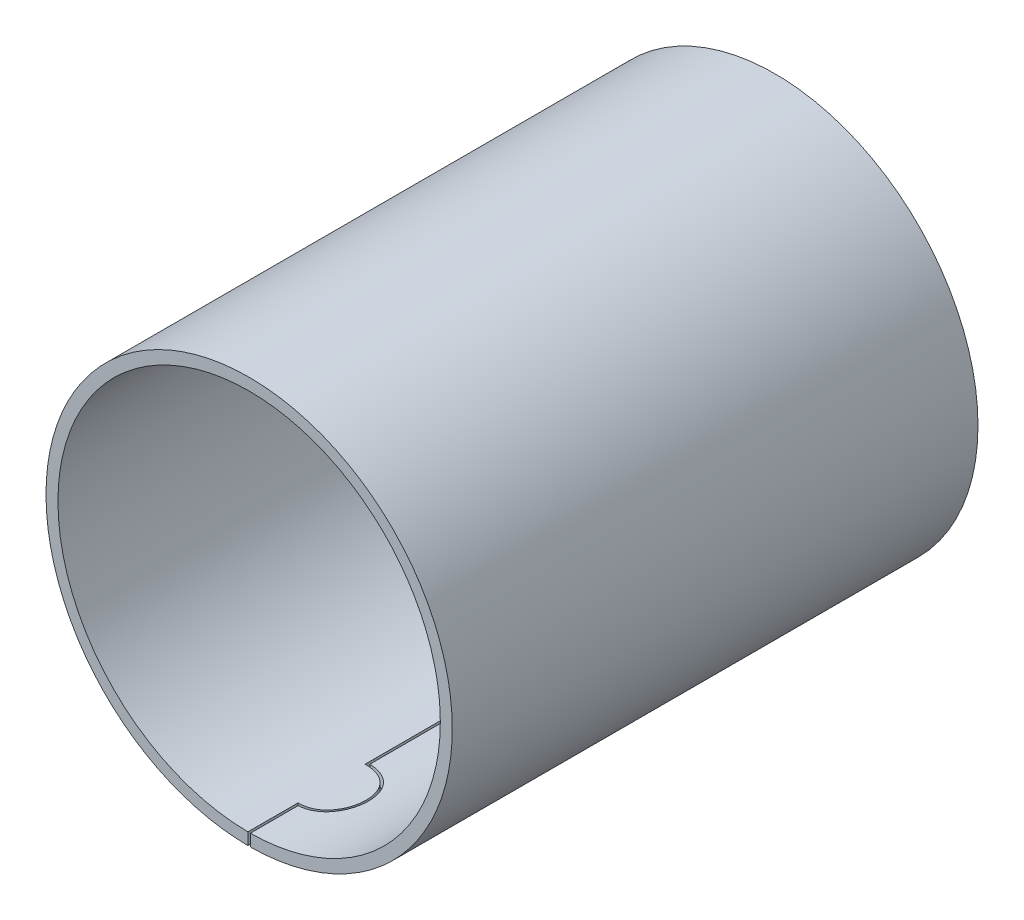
ISO-10303-21;
HEADER;
FILE_DESCRIPTION(('STEP AP214'),'2;1');
FILE_NAME('part.step','',(''),(''),'','','');
FILE_SCHEMA(('AUTOMOTIVE_DESIGN { 1 0 10303 214 1 1 1 1 }'));
ENDSEC;
DATA;
#1=APPLICATION_CONTEXT('core data for automotive mechanical design processes');
#2=APPLICATION_PROTOCOL_DEFINITION('international standard','automotive_design',2000,#1);
#3=PRODUCT_CONTEXT('',#1,'mechanical');
#4=PRODUCT('Part','Part','',(#3));
#5=PRODUCT_RELATED_PRODUCT_CATEGORY('part','',(#4));
#6=PRODUCT_DEFINITION_FORMATION('','',#4);
#7=PRODUCT_DEFINITION_CONTEXT('part definition',#1,'design');
#8=PRODUCT_DEFINITION('design','',#6,#7);
#9=PRODUCT_DEFINITION_SHAPE('','',#8);
#10=(LENGTH_UNIT() NAMED_UNIT(*) SI_UNIT(.MILLI.,.METRE.));
#11=(NAMED_UNIT(*) PLANE_ANGLE_UNIT() SI_UNIT($,.RADIAN.));
#12=(NAMED_UNIT(*) SI_UNIT($,.STERADIAN.) SOLID_ANGLE_UNIT());
#13=UNCERTAINTY_MEASURE_WITH_UNIT(LENGTH_MEASURE(1.E-05),#10,'distance_accuracy_value','');
#14=(GEOMETRIC_REPRESENTATION_CONTEXT(3) GLOBAL_UNCERTAINTY_ASSIGNED_CONTEXT((#13)) GLOBAL_UNIT_ASSIGNED_CONTEXT((#10,
#11,#12)) REPRESENTATION_CONTEXT('',''));
#15=CARTESIAN_POINT('',(0.,0.,0.));
#16=DIRECTION('',(0.,0.,1.));
#17=DIRECTION('',(1.,0.,0.));
#18=AXIS2_PLACEMENT_3D('',#15,#16,#17);
#19=CARTESIAN_POINT('',(0.05,-8.49985294,-8.999166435));
#20=DIRECTION('',(1.,0.,0.));
#21=DIRECTION('',(0.,0.,-1.));
#22=AXIS2_PLACEMENT_3D('',#19,#20,#21);
#23=PLANE('',#22);
#24=DIRECTION('',(0.,1.,0.));
#25=VECTOR('',#24,1.);
#26=CARTESIAN_POINT('',(0.0500000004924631,-8.178741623,-8.99916643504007));
#27=LINE('',#26,#25);
#28=CARTESIAN_POINT('',(0.0499999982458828,-7.99984374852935,-8.99916643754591));
#29=VERTEX_POINT('',#28);
#30=CARTESIAN_POINT('',(0.0499999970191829,-8.4998529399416,-8.99916643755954));
#31=VERTEX_POINT('',#30);
#32=EDGE_CURVE('E166',#29,#31,#27,.F.);
#33=ORIENTED_EDGE('',*,*,#32,.F.);
#34=DIRECTION('',(0.,0.,-1.));
#35=VECTOR('',#34,1.);
#36=CARTESIAN_POINT('',(0.049999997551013,-7.9998437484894,0.));
#37=LINE('',#36,#35);
#38=CARTESIAN_POINT('',(0.0499999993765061,-7.99984374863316,-11.));
#39=VERTEX_POINT('',#38);
#40=EDGE_CURVE('E164',#39,#29,#37,.F.);
#41=ORIENTED_EDGE('',*,*,#40,.F.);
#42=DIRECTION('',(0.,1.,0.));
#43=VECTOR('',#42,1.);
#44=CARTESIAN_POINT('',(0.05,-8.249848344,-11.));
#45=LINE('',#44,#43);
#46=CARTESIAN_POINT('',(0.0499999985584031,-8.49985293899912,-11.));
#47=VERTEX_POINT('',#46);
#48=EDGE_CURVE('E157',#47,#39,#45,.T.);
#49=ORIENTED_EDGE('',*,*,#48,.F.);
#50=DIRECTION('',(0.,0.,-1.));
#51=VECTOR('',#50,1.);
#52=CARTESIAN_POINT('',(0.0499999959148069,-8.49985293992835,0.));
#53=LINE('',#52,#51);
#54=EDGE_CURVE('E161',#47,#31,#53,.F.);
#55=ORIENTED_EDGE('',*,*,#54,.T.);
#56=EDGE_LOOP('',(#33,#41,#49,#55));
#57=FACE_BOUND('',#56,.T.);
#58=ADVANCED_FACE('F17',(#57),#23,.F.);
#59=CARTESIAN_POINT('',(0.,-8.50370340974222,-7.5));
#60=DIRECTION('',(0.,1.,0.));
#61=DIRECTION('',(0.,0.,1.));
#62=AXIS2_PLACEMENT_3D('',#59,#60,#61);
#63=CYLINDRICAL_SURFACE('',#62,1.5);
#64=DIRECTION('',(0.,1.,0.));
#65=VECTOR('',#64,1.);
#66=CARTESIAN_POINT('',(0.05,-8.249848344,-6.000833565));
#67=LINE('',#66,#65);
#68=CARTESIAN_POINT('',(0.0499999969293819,-8.49985293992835,-6.00083356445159));
#69=VERTEX_POINT('',#68);
#70=CARTESIAN_POINT('',(0.0499999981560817,-7.99984374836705,-6.00083356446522));
#71=VERTEX_POINT('',#70);
#72=EDGE_CURVE('E409',#69,#71,#67,.T.);
#73=ORIENTED_EDGE('',*,*,#72,.T.);
#74=CARTESIAN_POINT('',(0.049999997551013,-7.9998437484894,-8.99916644));
#75=CARTESIAN_POINT('',(0.0740821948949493,-7.99969359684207,-8.99836436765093));
#76=CARTESIAN_POINT('',(0.0981446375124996,-7.99943410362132,-8.99698362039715));
#77=CARTESIAN_POINT('',(0.146122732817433,-7.99870120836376,-8.99306928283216));
#78=CARTESIAN_POINT('',(0.170038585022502,-7.99822824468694,-8.99053805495));
#79=CARTESIAN_POINT('',(0.217721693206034,-7.99707237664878,-8.98432312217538));
#80=CARTESIAN_POINT('',(0.241488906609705,-7.99638941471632,-8.98063910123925));
#81=CARTESIAN_POINT('',(0.288873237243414,-7.99481804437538,-8.9721221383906));
#82=CARTESIAN_POINT('',(0.312489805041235,-7.99392910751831,-8.9672862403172));
#83=CARTESIAN_POINT('',(0.359387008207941,-7.99195784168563,-8.95650948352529));
#84=CARTESIAN_POINT('',(0.3826684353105,-7.99087609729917,-8.95057196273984));
#85=CARTESIAN_POINT('',(0.428872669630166,-7.98852943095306,-8.93759652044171));
#86=CARTESIAN_POINT('',(0.451795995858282,-7.98726480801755,-8.93056039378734));
#87=CARTESIAN_POINT('',(0.4972833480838,-7.98456190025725,-8.91539046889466));
#88=CARTESIAN_POINT('',(0.519847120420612,-7.98312349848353,-8.90725593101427));
#89=CARTESIAN_POINT('',(0.564615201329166,-7.98008236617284,-8.88989201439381));
#90=CARTESIAN_POINT('',(0.586818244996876,-7.97847916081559,-8.88065945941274));
#91=CARTESIAN_POINT('',(0.630795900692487,-7.97512280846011,-8.86113118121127));
#92=CARTESIAN_POINT('',(0.652569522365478,-7.97336935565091,-8.85083328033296));
#93=CARTESIAN_POINT('',(0.69554884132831,-7.96973501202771,-8.82922219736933));
#94=CARTESIAN_POINT('',(0.716755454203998,-7.96785434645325,-8.8179107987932));
#95=CARTESIAN_POINT('',(0.758601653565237,-7.96397923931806,-8.79427540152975));
#96=CARTESIAN_POINT('',(0.779240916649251,-7.9619847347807,-8.78195084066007));
#97=CARTESIAN_POINT('',(0.819953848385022,-7.95789516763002,-8.75629172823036));
#98=CARTESIAN_POINT('',(0.84002574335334,-7.95579983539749,-8.7429544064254));
#99=CARTESIAN_POINT('',(0.879373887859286,-7.95154642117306,-8.71543223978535));
#100=CARTESIAN_POINT('',(0.898654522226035,-7.94938884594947,-8.70125358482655));
#101=CARTESIAN_POINT('',(0.936469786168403,-7.94502271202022,-8.67202229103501));
#102=CARTESIAN_POINT('',(0.955005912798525,-7.94281427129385,-8.65697157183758));
#103=CARTESIAN_POINT('',(0.99133458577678,-7.93836196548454,-8.62599856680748));
#104=CARTESIAN_POINT('',(1.0091270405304,-7.93611809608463,-8.61007617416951));
#105=CARTESIAN_POINT('',(1.04397120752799,-7.93160976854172,-8.5773620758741));
#106=CARTESIAN_POINT('',(1.06102106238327,-7.92934527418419,-8.56056839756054));
#107=CARTESIAN_POINT('',(1.0944073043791,-7.92480650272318,-8.52608645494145));
#108=CARTESIAN_POINT('',(1.11073870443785,-7.92253225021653,-8.50839335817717));
#109=CARTESIAN_POINT('',(1.1424877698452,-7.91801605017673,-8.47228648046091));
#110=CARTESIAN_POINT('',(1.15790777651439,-7.91577403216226,-8.45387476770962));
#111=CARTESIAN_POINT('',(1.18783776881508,-7.91133808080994,-8.41633279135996));
#112=CARTESIAN_POINT('',(1.2023481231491,-7.90914412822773,-8.39720282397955));
#113=CARTESIAN_POINT('',(1.23046288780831,-7.90481902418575,-8.35822632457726));
#114=CARTESIAN_POINT('',(1.24406553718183,-7.90268799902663,-8.33837850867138));
#115=CARTESIAN_POINT('',(1.27026745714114,-7.89851858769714,-8.29812067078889));
#116=CARTESIAN_POINT('',(1.28287004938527,-7.89647990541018,-8.27771284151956));
#117=CARTESIAN_POINT('',(1.30704739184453,-7.89251397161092,-8.23636981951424));
#118=CARTESIAN_POINT('',(1.31862513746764,-7.89058640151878,-8.21543640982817));
#119=CARTESIAN_POINT('',(1.34075713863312,-7.8868559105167,-8.17304402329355));
#120=CARTESIAN_POINT('',(1.35131213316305,-7.88505289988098,-8.15158544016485));
#121=CARTESIAN_POINT('',(1.37140311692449,-7.88158344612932,-8.10814425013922));
#122=CARTESIAN_POINT('',(1.38093746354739,-7.87991722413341,-8.0861608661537));
#123=CARTESIAN_POINT('',(1.39900649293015,-7.87672936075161,-8.0416297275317));
#124=CARTESIAN_POINT('',(1.40753515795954,-7.87520859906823,-8.01907946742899));
#125=CARTESIAN_POINT('',(1.42347220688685,-7.87234350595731,-7.97365181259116));
#126=CARTESIAN_POINT('',(1.43088388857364,-7.87099865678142,-7.95077560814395));
#127=CARTESIAN_POINT('',(1.44459117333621,-7.86849444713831,-7.90469737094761));
#128=CARTESIAN_POINT('',(1.45088749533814,-7.86733496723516,-7.88149555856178));
#129=CARTESIAN_POINT('',(1.46236910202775,-7.86520888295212,-7.8347672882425));
#130=CARTESIAN_POINT('',(1.46755244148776,-7.86424261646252,-7.81124033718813));
#131=CARTESIAN_POINT('',(1.47678497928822,-7.86251411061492,-7.7639788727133));
#132=CARTESIAN_POINT('',(1.48083516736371,-7.86175169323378,-7.74024455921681));
#133=CARTESIAN_POINT('',(1.4877791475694,-7.86044055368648,-7.69264247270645));
#134=CARTESIAN_POINT('',(1.49067488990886,-7.85989147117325,-7.66877499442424));
#135=CARTESIAN_POINT('',(1.49531367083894,-7.85901028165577,-7.62090743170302));
#136=CARTESIAN_POINT('',(1.49705589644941,-7.85867832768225,-7.59690726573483));
#137=CARTESIAN_POINT('',(1.49939365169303,-7.85823263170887,-7.5487746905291));
#138=CARTESIAN_POINT('',(1.49998560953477,-7.85811956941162,-7.5246421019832));
#139=CARTESIAN_POINT('',(1.50001414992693,-7.85811412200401,-7.47649574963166));
#140=CARTESIAN_POINT('',(1.49945644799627,-7.85822064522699,-7.45248199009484));
#141=CARTESIAN_POINT('',(1.49718037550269,-7.85865460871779,-7.40453673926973));
#142=CARTESIAN_POINT('',(1.49546322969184,-7.85898181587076,-7.38060518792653));
#143=CARTESIAN_POINT('',(1.49087342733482,-7.85985380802,-7.33282445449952));
#144=CARTESIAN_POINT('',(1.4879992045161,-7.8603988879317,-7.30897542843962));
#145=CARTESIAN_POINT('',(1.48109754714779,-7.86170225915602,-7.2613593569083));
#146=CARTESIAN_POINT('',(1.47706582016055,-7.86246134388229,-7.23759295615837));
#147=CARTESIAN_POINT('',(1.46787193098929,-7.86418297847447,-7.19026927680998));
#148=CARTESIAN_POINT('',(1.46270894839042,-7.86514567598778,-7.16671216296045));
#149=CARTESIAN_POINT('',(1.45126069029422,-7.86726612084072,-7.11991592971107));
#150=CARTESIAN_POINT('',(1.4449769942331,-7.86842359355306,-7.09667641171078));
#151=CARTESIAN_POINT('',(1.43128954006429,-7.87092489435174,-7.05051475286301));
#152=CARTESIAN_POINT('',(1.42388467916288,-7.87226890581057,-7.0275929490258));
#153=CARTESIAN_POINT('',(1.40795602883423,-7.87513336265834,-6.98206587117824));
#154=CARTESIAN_POINT('',(1.39942855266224,-7.87665438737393,-6.9594619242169));
#155=CARTESIAN_POINT('',(1.38138302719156,-7.87983909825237,-6.91488849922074));
#156=CARTESIAN_POINT('',(1.37187404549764,-7.88150145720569,-6.89291525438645));
#157=CARTESIAN_POINT('',(1.35182999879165,-7.88496410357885,-6.84948601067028));
#158=CARTESIAN_POINT('',(1.34129622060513,-7.88676421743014,-6.82802940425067));
#159=CARTESIAN_POINT('',(1.31920342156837,-7.89048971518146,-6.78563242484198));
#160=CARTESIAN_POINT('',(1.30764331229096,-7.8924152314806,-6.76469263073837));
#161=CARTESIAN_POINT('',(1.28349845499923,-7.89637776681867,-6.72332793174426));
#162=CARTESIAN_POINT('',(1.27091037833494,-7.89841514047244,-6.70290500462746));
#163=CARTESIAN_POINT('',(1.24474583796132,-7.90258083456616,-6.66263061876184));
#164=CARTESIAN_POINT('',(1.23116672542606,-7.90470939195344,-6.64278090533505));
#165=CARTESIAN_POINT('',(1.20309313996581,-7.90903080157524,-6.60379357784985));
#166=CARTESIAN_POINT('',(1.18860011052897,-7.91122354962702,-6.58465491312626));
#167=CARTESIAN_POINT('',(1.15869936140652,-7.91565817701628,-6.54708819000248));
#168=CARTESIAN_POINT('',(1.14329096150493,-7.91790009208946,-6.5286606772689));
#169=CARTESIAN_POINT('',(1.11156006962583,-7.92241703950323,-6.49251440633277));
#170=CARTESIAN_POINT('',(1.09523493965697,-7.92469215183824,-6.47479797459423));
#171=CARTESIAN_POINT('',(1.06185969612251,-7.92923300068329,-6.44026970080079));
#172=CARTESIAN_POINT('',(1.04481458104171,-7.93149871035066,-6.42345302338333));
#173=CARTESIAN_POINT('',(1.00997132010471,-7.93601070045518,-6.3906890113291));
#174=CARTESIAN_POINT('',(0.9921747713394,-7.93825701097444,-6.37473998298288));
#175=CARTESIAN_POINT('',(0.95582974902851,-7.94271520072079,-6.34370938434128));
#176=CARTESIAN_POINT('',(0.937281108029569,-7.94492707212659,-6.32862800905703));
#177=CARTESIAN_POINT('',(0.899432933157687,-7.94930085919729,-6.2993305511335));
#178=CARTESIAN_POINT('',(0.880131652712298,-7.95146263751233,-6.28511670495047));
#179=CARTESIAN_POINT('',(0.840818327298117,-7.95571596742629,-6.25758168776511));
#180=CARTESIAN_POINT('',(0.820804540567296,-7.95780731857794,-6.24426297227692));
#181=CARTESIAN_POINT('',(0.78020194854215,-7.96189048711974,-6.21863281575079));
#182=CARTESIAN_POINT('',(0.759614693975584,-7.96388253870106,-6.20631895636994));
#183=CARTESIAN_POINT('',(0.717866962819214,-7.96775416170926,-6.18269623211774));
#184=CARTESIAN_POINT('',(0.696706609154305,-7.96963375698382,-6.17138715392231));
#185=CARTESIAN_POINT('',(0.653814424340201,-7.97326726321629,-6.14977145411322));
#186=CARTESIAN_POINT('',(0.632081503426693,-7.97502090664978,-6.13946695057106));
#187=CARTESIAN_POINT('',(0.588121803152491,-7.97838324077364,-6.11989371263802));
#188=CARTESIAN_POINT('',(0.565894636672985,-7.97999181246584,-6.11062582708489));
#189=CARTESIAN_POINT('',(0.5210680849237,-7.98304399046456,-6.09319295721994));
#190=CARTESIAN_POINT('',(0.49846983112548,-7.98448801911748,-6.08502513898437));
#191=CARTESIAN_POINT('',(0.452903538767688,-7.9872022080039,-6.06978977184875));
#192=CARTESIAN_POINT('',(0.42993562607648,-7.98847242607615,-6.06272185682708));
#193=CARTESIAN_POINT('',(0.383632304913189,-7.99083003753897,-6.04968348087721));
#194=CARTESIAN_POINT('',(0.360296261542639,-7.99191706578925,-6.04371520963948));
#195=CARTESIAN_POINT('',(0.313281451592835,-7.99389830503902,-6.03288043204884));
#196=CARTESIAN_POINT('',(0.28960181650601,-7.99479187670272,-6.0280175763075));
#197=CARTESIAN_POINT('',(0.242085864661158,-7.99637156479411,-6.01945389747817));
#198=CARTESIAN_POINT('',(0.21825006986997,-7.99705818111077,-6.01575027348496));
#199=CARTESIAN_POINT('',(0.170424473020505,-7.99822025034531,-6.00950265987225));
#200=CARTESIAN_POINT('',(0.146434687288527,-7.99869572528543,-6.0069585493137));
#201=CARTESIAN_POINT('',(0.0983033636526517,-7.99943239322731,-6.0030250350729));
#202=CARTESIAN_POINT('',(0.0741616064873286,-7.9996931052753,-6.00163822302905));
#203=CARTESIAN_POINT('',(0.049999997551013,-7.9998437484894,-6.000833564));
#204=B_SPLINE_CURVE_WITH_KNOTS('',3,(#74,#75,#76,#77,#78,#79,#80,#81,#82,#83,#84,#85,#86,#87,
#88,#89,#90,#91,#92,#93,#94,#95,#96,#97,#98,#99,#100,#101,#102,#103,#104,#105,#106,#107,#108,
#109,#110,#111,#112,#113,#114,#115,#116,#117,#118,#119,#120,#121,#122,#123,#124,#125,#126,#127,
#128,#129,#130,#131,#132,#133,#134,#135,#136,#137,#138,#139,#140,#141,#142,#143,#144,#145,#146,
#147,#148,#149,#150,#151,#152,#153,#154,#155,#156,#157,#158,#159,#160,#161,#162,#163,#164,#165,
#166,#167,#168,#169,#170,#171,#172,#173,#174,#175,#176,#177,#178,#179,#180,#181,#182,#183,#184,
#185,#186,#187,#188,#189,#190,#191,#192,#193,#194,#195,#196,#197,#198,#199,#200,#201,#202,#203),
.UNSPECIFIED.,.F.,.F.,(4,2,2,2,2,2,2,2,2,2,2,2,2,2,2,2,2,2,2,2,2,2,2,2,2,2,2,2,2,2,2,2,2,2,2,2,
2,2,2,2,2,2,2,2,2,2,2,2,2,2,2,2,2,2,2,2,2,2,2,2,2,2,2,2,4),(0.,0.0722811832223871,
0.144414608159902,0.21656782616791,0.288908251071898,0.361032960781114,0.433041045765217,
0.505097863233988,0.577368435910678,0.649789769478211,0.722086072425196,0.794422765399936,
0.86696499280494,0.939027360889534,1.0109367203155,1.082854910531,1.15494371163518,
1.22747229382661,1.29980563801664,1.37210947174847,1.44454972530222,1.51673831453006,
1.58870841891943,1.66062612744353,1.73265789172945,1.80510087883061,1.87732560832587,
1.94950361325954,2.02180675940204,2.09404655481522,2.16616379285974,2.2383318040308,
2.31072355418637,2.38275627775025,2.45471302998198,2.52676751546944,2.59909273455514,
2.67147058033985,2.74374721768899,2.81609541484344,2.88868742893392,2.96066038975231,
3.03254411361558,3.10450500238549,3.17670892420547,3.24911344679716,3.32140634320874,
3.39375364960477,3.46632102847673,3.53844821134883,3.61042913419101,3.68242617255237,
3.75460159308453,3.82696754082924,3.89915385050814,3.97132479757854,4.04364476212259,
4.11602351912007,4.18821209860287,4.26037659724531,4.33268327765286,4.4052253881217,
4.47759084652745,4.54994875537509,4.62246826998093),.UNSPECIFIED.);
#205=EDGE_CURVE('E352',#29,#71,#204,.T.);
#206=ORIENTED_EDGE('',*,*,#205,.F.);
#207=ORIENTED_EDGE('',*,*,#32,.T.);
#208=CARTESIAN_POINT('',(0.0499999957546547,-8.49985293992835,-8.99916643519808));
#209=CARTESIAN_POINT('',(0.0651125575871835,-8.49976392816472,-8.99866248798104));
#210=CARTESIAN_POINT('',(0.0802172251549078,-8.49963218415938,-8.99792986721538));
#211=CARTESIAN_POINT('',(0.110560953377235,-8.49928398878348,-8.99599793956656));
#212=CARTESIAN_POINT('',(0.125799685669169,-8.49906663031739,-8.99479363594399));
#213=CARTESIAN_POINT('',(0.156396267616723,-8.49854721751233,-8.99190445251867));
#214=CARTESIAN_POINT('',(0.171753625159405,-8.4982442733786,-8.99021452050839));
#215=CARTESIAN_POINT('',(0.202571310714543,-8.49755366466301,-8.98634068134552));
#216=CARTESIAN_POINT('',(0.218030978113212,-8.49716512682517,-8.98415167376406));
#217=CARTESIAN_POINT('',(0.249036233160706,-8.49630331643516,-8.97926666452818));
#218=CARTESIAN_POINT('',(0.264580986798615,-8.49582918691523,-8.97656552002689));
#219=CARTESIAN_POINT('',(0.295738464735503,-8.49479617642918,-8.97064369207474));
#220=CARTESIAN_POINT('',(0.311350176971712,-8.49423645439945,-8.96741782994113));
#221=CARTESIAN_POINT('',(0.342622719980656,-8.49303224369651,-8.96043453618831));
#222=CARTESIAN_POINT('',(0.358282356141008,-8.492386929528,-8.95667189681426));
#223=CARTESIAN_POINT('',(0.389630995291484,-8.49101151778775,-8.94860358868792));
#224=CARTESIAN_POINT('',(0.405318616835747,-8.49028060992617,-8.94429269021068));
#225=CARTESIAN_POINT('',(0.436702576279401,-8.48873400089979,-8.93511703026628));
#226=CARTESIAN_POINT('',(0.452397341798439,-8.487917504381,-8.93024702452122));
#227=CARTESIAN_POINT('',(0.483774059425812,-8.4861996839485,-8.91994299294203));
#228=CARTESIAN_POINT('',(0.49945424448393,-8.48529757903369,-8.91450371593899));
#229=CARTESIAN_POINT('',(0.530779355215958,-8.48340860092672,-8.9030517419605));
#230=CARTESIAN_POINT('',(0.546422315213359,-8.4824209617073,-8.89703379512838));
#231=CARTESIAN_POINT('',(0.577649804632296,-8.48036062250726,-8.88441580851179));
#232=CARTESIAN_POINT('',(0.593232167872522,-8.47928716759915,-8.87781052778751));
#233=CARTESIAN_POINT('',(0.622079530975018,-8.47721661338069,-8.86500238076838));
#234=CARTESIAN_POINT('',(0.63537428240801,-8.47622866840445,-8.85886491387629));
#235=CARTESIAN_POINT('',(0.662282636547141,-8.47416600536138,-8.84596166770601));
#236=CARTESIAN_POINT('',(0.675888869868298,-8.47308941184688,-8.83918080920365));
#237=CARTESIAN_POINT('',(0.703385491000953,-8.47084903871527,-8.82495179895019));
#238=CARTESIAN_POINT('',(0.717267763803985,-8.46968350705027,-8.81748823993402));
#239=CARTESIAN_POINT('',(0.745278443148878,-8.46726537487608,-8.80185498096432));
#240=CARTESIAN_POINT('',(0.759397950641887,-8.46601115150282,-8.79366958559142));
#241=CARTESIAN_POINT('',(0.787841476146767,-8.46341479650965,-8.7765542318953));
#242=CARTESIAN_POINT('',(0.802155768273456,-8.46207112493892,-8.7676083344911));
#243=CARTESIAN_POINT('',(0.830943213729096,-8.45929855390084,-8.74893453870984));
#244=CARTESIAN_POINT('',(0.845405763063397,-8.45786830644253,-8.73919051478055));
#245=CARTESIAN_POINT('',(0.879209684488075,-8.45442601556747,-8.71554821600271));
#246=CARTESIAN_POINT('',(0.898399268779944,-8.45239263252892,-8.70143480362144));
#247=CARTESIAN_POINT('',(0.929051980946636,-8.44905116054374,-8.67774588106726));
#248=CARTESIAN_POINT('',(0.940727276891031,-8.44775543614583,-8.66844129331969));
#249=CARTESIAN_POINT('',(0.965351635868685,-8.44497726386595,-8.64820870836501));
#250=CARTESIAN_POINT('',(0.978259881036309,-8.44349322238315,-8.63723112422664));
#251=CARTESIAN_POINT('',(1.00520914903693,-8.44033880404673,-8.61351423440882));
#252=CARTESIAN_POINT('',(1.01920230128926,-8.4386672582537,-8.60072068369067));
#253=CARTESIAN_POINT('',(1.04815420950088,-8.43513437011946,-8.57322529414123));
#254=CARTESIAN_POINT('',(1.06305750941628,-8.43327173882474,-8.55846515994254));
#255=CARTESIAN_POINT('',(1.0915082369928,-8.42964146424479,-8.52908065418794));
#256=CARTESIAN_POINT('',(1.10508624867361,-8.42787369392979,-8.51448589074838));
#257=CARTESIAN_POINT('',(1.13060973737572,-8.42449484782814,-8.48593054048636));
#258=CARTESIAN_POINT('',(1.14259975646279,-8.42288235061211,-8.47200991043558));
#259=CARTESIAN_POINT('',(1.16506359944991,-8.41981059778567,-8.44493877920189));
#260=CARTESIAN_POINT('',(1.17557964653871,-8.41834997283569,-8.43182347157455));
#261=CARTESIAN_POINT('',(1.19520878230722,-8.4155831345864,-8.40648136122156));
#262=CARTESIAN_POINT('',(1.20436141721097,-8.41427518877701,-8.39428529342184));
#263=CARTESIAN_POINT('',(1.22850050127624,-8.41078246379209,-8.36107627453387));
#264=CARTESIAN_POINT('',(1.24313827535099,-8.40861762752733,-8.33980561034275));
#265=CARTESIAN_POINT('',(1.26660178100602,-8.40510457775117,-8.30375117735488));
#266=CARTESIAN_POINT('',(1.27573737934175,-8.40372486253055,-8.28917058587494));
#267=CARTESIAN_POINT('',(1.29324462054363,-8.40105231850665,-8.26012981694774));
#268=CARTESIAN_POINT('',(1.30163077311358,-8.39975812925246,-8.24567852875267));
#269=CARTESIAN_POINT('',(1.31767276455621,-8.39725864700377,-8.2169387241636));
#270=CARTESIAN_POINT('',(1.32534297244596,-8.39605185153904,-8.20265835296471));
#271=CARTESIAN_POINT('',(1.3399879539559,-8.39372672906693,-8.17429891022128));
#272=CARTESIAN_POINT('',(1.34697690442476,-8.39260681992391,-8.16022728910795));
#273=CARTESIAN_POINT('',(1.36029473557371,-8.3904557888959,-8.13232078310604));
#274=CARTESIAN_POINT('',(1.36663756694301,-8.38942297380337,-8.11849268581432));
#275=CARTESIAN_POINT('',(1.3786988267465,-8.38744587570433,-8.09110573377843));
#276=CARTESIAN_POINT('',(1.38443094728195,-8.38649979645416,-8.07755303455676));
#277=CARTESIAN_POINT('',(1.39629042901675,-8.38453446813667,-8.0483213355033));
#278=CARTESIAN_POINT('',(1.40235618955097,-8.38352424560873,-8.03261668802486));
#279=CARTESIAN_POINT('',(1.41390604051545,-8.38159249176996,-8.00114686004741));
#280=CARTESIAN_POINT('',(1.41939477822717,-8.38067025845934,-7.98538342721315));
#281=CARTESIAN_POINT('',(1.42979808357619,-8.37891411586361,-7.95381839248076));
#282=CARTESIAN_POINT('',(1.43471730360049,-8.37807949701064,-7.9380183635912));
#283=CARTESIAN_POINT('',(1.44398978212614,-8.37649869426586,-7.90640187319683));
#284=CARTESIAN_POINT('',(1.44834769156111,-8.37575178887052,-7.8905868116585));
#285=CARTESIAN_POINT('',(1.45650648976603,-8.37434639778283,-7.8589611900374));
#286=CARTESIAN_POINT('',(1.46031202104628,-8.37368717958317,-7.8431518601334));
#287=CARTESIAN_POINT('',(1.46737566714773,-8.3724571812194,-7.81155786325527));
#288=CARTESIAN_POINT('',(1.47063840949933,-8.37188565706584,-7.79577425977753));
#289=CARTESIAN_POINT('',(1.47662670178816,-8.37083105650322,-7.76425108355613));
#290=CARTESIAN_POINT('',(1.47935685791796,-8.37034722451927,-7.74851241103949));
#291=CARTESIAN_POINT('',(1.48429077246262,-8.36946802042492,-7.71709766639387));
#292=CARTESIAN_POINT('',(1.48649910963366,-8.36907188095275,-7.70142233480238));
#293=CARTESIAN_POINT('',(1.49040070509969,-8.36836807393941,-7.67015203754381));
#294=CARTESIAN_POINT('',(1.49209850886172,-8.36805962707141,-7.65455765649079));
#295=CARTESIAN_POINT('',(1.49499083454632,-8.36753121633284,-7.62346621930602));
#296=CARTESIAN_POINT('',(1.49618986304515,-8.36731046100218,-7.60796959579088));
#297=CARTESIAN_POINT('',(1.49809686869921,-8.36695744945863,-7.57708982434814));
#298=CARTESIAN_POINT('',(1.49880930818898,-8.36682438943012,-7.56170696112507));
#299=CARTESIAN_POINT('',(1.49975575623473,-8.36664676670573,-7.53107005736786));
#300=CARTESIAN_POINT('',(1.4999941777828,-8.36660138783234,-7.51581615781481));
#301=CARTESIAN_POINT('',(1.50000561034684,-8.3665991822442,-7.48531133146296));
#302=CARTESIAN_POINT('',(1.49977871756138,-8.36664233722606,-7.47006040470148));
#303=CARTESIAN_POINT('',(1.49885561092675,-8.36681555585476,-7.43942890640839));
#304=CARTESIAN_POINT('',(1.49815497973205,-8.36694643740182,-7.42404847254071));
#305=CARTESIAN_POINT('',(1.49627184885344,-8.36729510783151,-7.39317300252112));
#306=CARTESIAN_POINT('',(1.49508488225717,-8.36751370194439,-7.37767824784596));
#307=CARTESIAN_POINT('',(1.49221691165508,-8.36803781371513,-7.34658997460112));
#308=CARTESIAN_POINT('',(1.49053139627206,-8.36834412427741,-7.33099688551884));
#309=CARTESIAN_POINT('',(1.48665458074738,-8.36904368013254,-7.29972858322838));
#310=CARTESIAN_POINT('',(1.48445873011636,-8.36943770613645,-7.28405395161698));
#311=CARTESIAN_POINT('',(1.47954996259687,-8.37031270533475,-7.25264000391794));
#312=CARTESIAN_POINT('',(1.47683246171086,-8.37079444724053,-7.23690142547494));
#313=CARTESIAN_POINT('',(1.47086962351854,-8.37184488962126,-7.20537782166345));
#314=CARTESIAN_POINT('',(1.46761967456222,-8.37241434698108,-7.18959369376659));
#315=CARTESIAN_POINT('',(1.46058172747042,-8.37364023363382,-7.15799802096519));
#316=CARTESIAN_POINT('',(1.45678909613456,-8.37429740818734,-7.142187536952));
#317=CARTESIAN_POINT('',(1.44865617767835,-8.37569873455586,-7.11055897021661));
#318=CARTESIAN_POINT('',(1.44431124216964,-8.37644362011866,-7.09474211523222));
#319=CARTESIAN_POINT('',(1.43506475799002,-8.37802040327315,-7.06312139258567));
#320=CARTESIAN_POINT('',(1.43015855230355,-8.37885302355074,-7.0473189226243));
#321=CARTESIAN_POINT('',(1.41978128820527,-8.38060519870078,-7.01574835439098));
#322=CARTESIAN_POINT('',(1.41430557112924,-8.38152546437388,-6.9999818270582));
#323=CARTESIAN_POINT('',(1.40278173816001,-8.38345327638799,-6.96850515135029));
#324=CARTESIAN_POINT('',(1.39672896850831,-8.38446152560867,-6.95279674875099));
#325=CARTESIAN_POINT('',(1.38489606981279,-8.38642289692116,-6.92356334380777));
#326=CARTESIAN_POINT('',(1.37917772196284,-8.38736695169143,-6.91001267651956));
#327=CARTESIAN_POINT('',(1.36714401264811,-8.38934019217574,-6.88262773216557));
#328=CARTESIAN_POINT('',(1.36081491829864,-8.39037118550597,-6.86879961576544));
#329=CARTESIAN_POINT('',(1.34752442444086,-8.39251873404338,-6.84089101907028));
#330=CARTESIAN_POINT('',(1.34054903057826,-8.39363699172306,-6.82681733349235));
#331=CARTESIAN_POINT('',(1.32593087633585,-8.39595898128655,-6.79845172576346));
#332=CARTESIAN_POINT('',(1.31827389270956,-8.39716430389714,-6.7841672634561));
#333=CARTESIAN_POINT('',(1.30225790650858,-8.39966101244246,-6.75541726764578));
#334=CARTESIAN_POINT('',(1.29388448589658,-8.40095390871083,-6.74095989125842));
#335=CARTESIAN_POINT('',(1.27640210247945,-8.40362402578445,-6.71190497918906));
#336=CARTESIAN_POINT('',(1.26727857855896,-8.40500261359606,-6.69731634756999));
#337=CARTESIAN_POINT('',(1.24382365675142,-8.40851618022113,-6.66120861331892));
#338=CARTESIAN_POINT('',(1.22918051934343,-8.41068290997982,-6.63989353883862));
#339=CARTESIAN_POINT('',(1.20504039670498,-8.41417767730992,-6.6066297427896));
#340=CARTESIAN_POINT('',(1.1958937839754,-8.41548551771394,-6.59442244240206));
#341=CARTESIAN_POINT('',(1.17628302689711,-8.41825142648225,-6.56906467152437));
#342=CARTESIAN_POINT('',(1.16577955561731,-8.41971123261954,-6.55594471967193));
#343=CARTESIAN_POINT('',(1.14334785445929,-8.42278063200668,-6.52887042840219));
#344=CARTESIAN_POINT('',(1.13137765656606,-8.42439160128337,-6.51495101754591));
#345=CARTESIAN_POINT('',(1.105901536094,-8.42776667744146,-6.48640338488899));
#346=CARTESIAN_POINT('',(1.09235135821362,-8.42953221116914,-6.47181480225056));
#347=CARTESIAN_POINT('',(1.06389735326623,-8.43316586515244,-6.44237773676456));
#348=CARTESIAN_POINT('',(1.04896032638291,-8.43503413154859,-6.42756133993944));
#349=CARTESIAN_POINT('',(1.01995041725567,-8.43857662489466,-6.39997175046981));
#350=CARTESIAN_POINT('',(1.0059337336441,-8.44025213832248,-6.38713956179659));
#351=CARTESIAN_POINT('',(0.978949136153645,-8.44341285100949,-6.36336179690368));
#352=CARTESIAN_POINT('',(0.96602969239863,-8.4448992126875,-6.35236136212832));
#353=CARTESIAN_POINT('',(0.941396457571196,-8.44768037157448,-6.33209774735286));
#354=CARTESIAN_POINT('',(0.929723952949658,-8.44897675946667,-6.32278446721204));
#355=CARTESIAN_POINT('',(0.899124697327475,-8.45231508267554,-6.29910905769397));
#356=CARTESIAN_POINT('',(0.879987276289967,-8.45434488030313,-6.28501565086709));
#357=CARTESIAN_POINT('',(0.846270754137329,-8.45778182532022,-6.26140051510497));
#358=CARTESIAN_POINT('',(0.831842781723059,-8.45921019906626,-6.25166489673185));
#359=CARTESIAN_POINT('',(0.803122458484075,-8.46197952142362,-6.23300431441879));
#360=CARTESIAN_POINT('',(0.788840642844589,-8.46332180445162,-6.22406335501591));
#361=CARTESIAN_POINT('',(0.760459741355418,-8.4659158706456,-6.20695462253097));
#362=CARTESIAN_POINT('',(0.746370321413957,-8.4671691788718,-6.19877103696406));
#363=CARTESIAN_POINT('',(0.718417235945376,-8.46958597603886,-6.18313849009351));
#364=CARTESIAN_POINT('',(0.704562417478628,-8.47075107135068,-6.17567395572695));
#365=CARTESIAN_POINT('',(0.677117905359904,-8.47299105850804,-6.1614404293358));
#366=CARTESIAN_POINT('',(0.663536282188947,-8.47406768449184,-6.15465614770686));
#367=CARTESIAN_POINT('',(0.636674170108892,-8.47613093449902,-6.1417438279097));
#368=CARTESIAN_POINT('',(0.623401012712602,-8.47711941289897,-6.13560082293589));
#369=CARTESIAN_POINT('',(0.594540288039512,-8.47919571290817,-6.12275287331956));
#370=CARTESIAN_POINT('',(0.578922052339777,-8.48027414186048,-6.11611516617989));
#371=CARTESIAN_POINT('',(0.547621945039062,-8.48234398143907,-6.10343547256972));
#372=CARTESIAN_POINT('',(0.531942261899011,-8.48333615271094,-6.09738820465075));
#373=CARTESIAN_POINT('',(0.500543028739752,-8.48523378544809,-6.08588068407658));
#374=CARTESIAN_POINT('',(0.484825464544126,-8.48614001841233,-6.08041514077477));
#375=CARTESIAN_POINT('',(0.453373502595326,-8.48786567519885,-6.07006161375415));
#376=CARTESIAN_POINT('',(0.437640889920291,-8.48868588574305,-6.06516833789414));
#377=CARTESIAN_POINT('',(0.406180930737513,-8.49023950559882,-6.05594910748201));
#378=CARTESIAN_POINT('',(0.390455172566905,-8.49097371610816,-6.05161786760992));
#379=CARTESIAN_POINT('',(0.359030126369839,-8.49235531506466,-6.043511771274));
#380=CARTESIAN_POINT('',(0.34333223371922,-8.49300351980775,-6.03973164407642));
#381=CARTESIAN_POINT('',(0.311983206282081,-8.49421309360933,-6.03271618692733));
#382=CARTESIAN_POINT('',(0.296333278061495,-8.49477529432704,-6.02947560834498));
#383=CARTESIAN_POINT('',(0.265099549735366,-8.4958128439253,-6.02352707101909));
#384=CARTESIAN_POINT('',(0.249516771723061,-8.4962890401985,-6.02081389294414));
#385=CARTESIAN_POINT('',(0.218435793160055,-8.49715456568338,-6.01590744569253));
#386=CARTESIAN_POINT('',(0.202938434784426,-8.4975447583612,-6.01370899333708));
#387=CARTESIAN_POINT('',(0.172045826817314,-8.49823825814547,-6.00981879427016));
#388=CARTESIAN_POINT('',(0.156651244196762,-8.49854244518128,-6.00812190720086));
#389=CARTESIAN_POINT('',(0.125980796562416,-8.49906392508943,-6.00522123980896));
#390=CARTESIAN_POINT('',(0.110705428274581,-8.49928211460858,-6.00401236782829));
#391=CARTESIAN_POINT('',(0.0802891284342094,-8.4996315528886,-6.00207362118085));
#392=CARTESIAN_POINT('',(0.0651485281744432,-8.49976371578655,-6.00133871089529));
#393=CARTESIAN_POINT('',(0.0499999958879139,-8.49985293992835,-6.00083356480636));
#394=B_SPLINE_CURVE_WITH_KNOTS('',3,(#208,#209,#210,#211,#212,#213,#214,#215,#216,#217,#218,
#219,#220,#221,#222,#223,#224,#225,#226,#227,#228,#229,#230,#231,#232,#233,#234,#235,#236,#237,
#238,#239,#240,#241,#242,#243,#244,#245,#246,#247,#248,#249,#250,#251,#252,#253,#254,#255,#256,
#257,#258,#259,#260,#261,#262,#263,#264,#265,#266,#267,#268,#269,#270,#271,#272,#273,#274,#275,
#276,#277,#278,#279,#280,#281,#282,#283,#284,#285,#286,#287,#288,#289,#290,#291,#292,#293,#294,
#295,#296,#297,#298,#299,#300,#301,#302,#303,#304,#305,#306,#307,#308,#309,#310,#311,#312,#313,
#314,#315,#316,#317,#318,#319,#320,#321,#322,#323,#324,#325,#326,#327,#328,#329,#330,#331,#332,
#333,#334,#335,#336,#337,#338,#339,#340,#341,#342,#343,#344,#345,#346,#347,#348,#349,#350,#351,
#352,#353,#354,#355,#356,#357,#358,#359,#360,#361,#362,#363,#364,#365,#366,#367,#368,#369,#370,
#371,#372,#373,#374,#375,#376,#377,#378,#379,#380,#381,#382,#383,#384,#385,#386,#387,#388,#389,
#390,#391,#392,#393),.UNSPECIFIED.,.F.,.F.,(4,2,2,2,2,2,2,2,2,2,2,2,2,2,2,2,2,2,2,2,2,2,2,2,2,2,
2,2,2,2,2,2,2,2,2,2,2,2,2,2,2,2,2,2,2,2,2,2,2,2,2,2,2,2,2,2,2,2,2,2,2,2,2,2,2,2,2,2,2,2,2,2,2,2,
2,2,2,2,2,2,2,2,2,2,2,2,2,2,2,2,2,2,4),(0.,0.0453618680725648,0.0912178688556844,
0.137569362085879,0.184417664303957,0.23176405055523,0.279609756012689,0.327955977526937,
0.376803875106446,0.426154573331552,0.476009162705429,0.526368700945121,0.577234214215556,
0.621257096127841,0.666971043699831,0.714376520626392,0.763473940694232,0.814263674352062,
0.866746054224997,0.938437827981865,0.983388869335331,1.03440816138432,1.09149552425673,
1.15465074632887,1.21467206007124,1.26998884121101,1.3206009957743,1.36650845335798,
1.44420272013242,1.49597802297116,1.54624337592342,1.59499918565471,1.6422458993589,
1.68798401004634,1.73221406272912,1.78280104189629,1.83294303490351,1.88264117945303,
1.93189664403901,1.98071062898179,2.02908436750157,2.07701912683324,2.12451620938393,
2.17157695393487,2.21820273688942,2.26439497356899,2.3101551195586,2.35590580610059,
2.40208908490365,2.44870641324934,2.49575920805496,2.54324884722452,2.59117667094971,
2.63954398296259,2.68835205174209,2.73760211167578,2.78729536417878,2.83743297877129,
2.88801609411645,2.93222411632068,2.97794478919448,3.02517866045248,3.07392622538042,
3.12418793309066,3.17596419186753,3.25377722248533,3.29970071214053,3.35029999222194,
3.40557499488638,3.46552562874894,3.52887209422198,3.58609023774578,3.63717984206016,
3.68214072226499,3.75367077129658,3.80605297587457,3.85675226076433,3.90576895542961,
3.95310342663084,3.99875608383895,4.04272738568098,4.09373055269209,4.1442250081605,
4.19421178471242,4.24369194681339,4.29266659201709,4.34113685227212,4.38910389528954,
4.4365689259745,4.48353318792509,4.52999796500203,4.57596458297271,4.62143441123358),.UNSPECIFIED.);
#395=EDGE_CURVE('E175',#31,#69,#394,.T.);
#396=ORIENTED_EDGE('',*,*,#395,.T.);
#397=EDGE_LOOP('',(#73,#206,#207,#396));
#398=FACE_BOUND('',#397,.T.);
#399=ADVANCED_FACE('F421',(#398),#63,.F.);
#400=CARTESIAN_POINT('',(0.05,-8.49985294,6.000833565));
#401=DIRECTION('',(1.,0.,0.));
#402=DIRECTION('',(0.,0.,-1.));
#403=AXIS2_PLACEMENT_3D('',#400,#401,#402);
#404=PLANE('',#403);
#405=DIRECTION('',(0.,1.,0.));
#406=VECTOR('',#405,1.);
#407=CARTESIAN_POINT('',(0.0500000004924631,-8.178741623,6.00083356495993));
#408=LINE('',#407,#406);
#409=CARTESIAN_POINT('',(0.0499999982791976,-7.99984374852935,6.00083356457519));
#410=VERTEX_POINT('',#409);
#411=CARTESIAN_POINT('',(0.0499999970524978,-8.4998529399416,6.00083356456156));
#412=VERTEX_POINT('',#411);
#413=EDGE_CURVE('E411',#410,#412,#408,.F.);
#414=ORIENTED_EDGE('',*,*,#413,.F.);
#415=DIRECTION('',(0.,0.,-1.));
#416=VECTOR('',#415,1.);
#417=CARTESIAN_POINT('',(0.049999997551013,-7.9998437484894,0.));
#418=LINE('',#417,#416);
#419=EDGE_CURVE('E723',#71,#410,#418,.F.);
#420=ORIENTED_EDGE('',*,*,#419,.F.);
#421=ORIENTED_EDGE('',*,*,#72,.F.);
#422=DIRECTION('',(0.,0.,-1.));
#423=VECTOR('',#422,1.);
#424=CARTESIAN_POINT('',(0.0499999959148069,-8.49985293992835,0.));
#425=LINE('',#424,#423);
#426=EDGE_CURVE('E392',#69,#412,#425,.F.);
#427=ORIENTED_EDGE('',*,*,#426,.T.);
#428=EDGE_LOOP('',(#414,#420,#421,#427));
#429=FACE_BOUND('',#428,.T.);
#430=ADVANCED_FACE('F430',(#429),#404,.F.);
#431=CARTESIAN_POINT('',(0.,-8.50370340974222,7.5));
#432=DIRECTION('',(0.,1.,0.));
#433=DIRECTION('',(0.,0.,1.));
#434=AXIS2_PLACEMENT_3D('',#431,#432,#433);
#435=CYLINDRICAL_SURFACE('',#434,1.5);
#436=CARTESIAN_POINT('',(0.049999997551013,-7.9998437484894,6.000833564));
#437=CARTESIAN_POINT('',(0.0740821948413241,-7.99969359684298,6.00163563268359));
#438=CARTESIAN_POINT('',(0.0981446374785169,-7.99943410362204,6.00301637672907));
#439=CARTESIAN_POINT('',(0.146122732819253,-7.99870120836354,6.00693070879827));
#440=CARTESIAN_POINT('',(0.170038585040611,-7.99822824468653,6.00946193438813));
#441=CARTESIAN_POINT('',(0.21772169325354,-7.99707237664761,6.01567686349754));
#442=CARTESIAN_POINT('',(0.241488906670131,-7.99638941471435,6.01936088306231));
#443=CARTESIAN_POINT('',(0.288873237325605,-7.99481804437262,6.02787784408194));
#444=CARTESIAN_POINT('',(0.31248980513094,-7.99392910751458,6.03271374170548));
#445=CARTESIAN_POINT('',(0.359387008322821,-7.99195784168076,6.04349049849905));
#446=CARTESIAN_POINT('',(0.382668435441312,-7.99087609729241,6.0494280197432));
#447=CARTESIAN_POINT('',(0.428872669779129,-7.98852943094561,6.06240346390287));
#448=CARTESIAN_POINT('',(0.451795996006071,-7.98726480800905,6.06943959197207));
#449=CARTESIAN_POINT('',(0.497283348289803,-7.98456190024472,6.08460952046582));
#450=CARTESIAN_POINT('',(0.51984712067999,-7.98312349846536,6.09274406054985));
#451=CARTESIAN_POINT('',(0.564615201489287,-7.98008236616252,6.11010798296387));
#452=CARTESIAN_POINT('',(0.586818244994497,-7.9784791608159,6.11934054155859));
#453=CARTESIAN_POINT('',(0.630795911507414,-7.97512280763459,6.13886883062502));
#454=CARTESIAN_POINT('',(0.652569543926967,-7.97336935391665,6.14916673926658));
#455=CARTESIAN_POINT('',(0.695548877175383,-7.96973500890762,6.17077783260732));
#456=CARTESIAN_POINT('',(0.716755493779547,-7.9678543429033,6.18208923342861));
#457=CARTESIAN_POINT('',(0.758601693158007,-7.96397923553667,6.20572463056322));
#458=CARTESIAN_POINT('',(0.779240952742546,-7.9619847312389,6.21804918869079));
#459=CARTESIAN_POINT('',(0.819953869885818,-7.9578951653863,6.24370829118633));
#460=CARTESIAN_POINT('',(0.840025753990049,-7.95579983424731,6.25704560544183));
#461=CARTESIAN_POINT('',(0.879373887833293,-7.95154642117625,6.28456776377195));
#462=CARTESIAN_POINT('',(0.898654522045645,-7.94938884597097,6.29874641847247));
#463=CARTESIAN_POINT('',(0.936469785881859,-7.94502271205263,6.32797771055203));
#464=CARTESIAN_POINT('',(0.955005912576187,-7.9428142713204,6.34302842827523));
#465=CARTESIAN_POINT('',(0.991334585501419,-7.93836196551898,6.37400142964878));
#466=CARTESIAN_POINT('',(1.00912704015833,-7.93611809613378,6.38992382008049));
#467=CARTESIAN_POINT('',(1.043971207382,-7.93160976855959,6.4226379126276));
#468=CARTESIAN_POINT('',(1.06102106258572,-7.92934527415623,6.43943158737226));
#469=CARTESIAN_POINT('',(1.09440729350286,-7.92480650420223,6.47391351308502));
#470=CARTESIAN_POINT('',(1.11073868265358,-7.92253225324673,6.49160659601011));
#471=CARTESIAN_POINT('',(1.14248773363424,-7.918016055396,6.52771345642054));
#472=CARTESIAN_POINT('',(1.15790773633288,-7.91577403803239,6.54612516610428));
#473=CARTESIAN_POINT('',(1.18783772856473,-7.91133808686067,6.58366714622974));
#474=CARTESIAN_POINT('',(1.20234808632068,-7.90914413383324,6.60279712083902));
#475=CARTESIAN_POINT('',(1.23046286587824,-7.90481902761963,6.64177364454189));
#476=CARTESIAN_POINT('',(1.24406552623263,-7.90268800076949,6.6616214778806));
#477=CARTESIAN_POINT('',(1.27026745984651,-7.89851858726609,6.70187933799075));
#478=CARTESIAN_POINT('',(1.28287005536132,-7.8964799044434,6.72228717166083));
#479=CARTESIAN_POINT('',(1.30704740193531,-7.89251396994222,6.76363019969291));
#480=CARTESIAN_POINT('',(1.31862514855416,-7.89058639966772,6.78456361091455));
#481=CARTESIAN_POINT('',(1.34075714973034,-7.88685590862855,6.82695599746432));
#482=CARTESIAN_POINT('',(1.35131214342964,-7.88505289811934,6.84841457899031));
#483=CARTESIAN_POINT('',(1.37140312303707,-7.88158344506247,6.89185576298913));
#484=CARTESIAN_POINT('',(1.3809374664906,-7.87991722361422,6.91383914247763));
#485=CARTESIAN_POINT('',(1.39900649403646,-7.87672936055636,6.95837028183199));
#486=CARTESIAN_POINT('',(1.40753515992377,-7.8752085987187,6.98092054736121));
#487=CARTESIAN_POINT('',(1.42347221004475,-7.87234350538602,7.0263482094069));
#488=CARTESIAN_POINT('',(1.43088389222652,-7.87099865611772,7.04922441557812));
#489=CARTESIAN_POINT('',(1.4445911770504,-7.86849444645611,7.09530265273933));
#490=CARTESIAN_POINT('',(1.45088749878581,-7.86733496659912,7.11850446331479));
#491=CARTESIAN_POINT('',(1.46236910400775,-7.8652088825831,7.16523272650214));
#492=CARTESIAN_POINT('',(1.46755244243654,-7.86424261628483,7.18875967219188));
#493=CARTESIAN_POINT('',(1.47678497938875,-7.86251411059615,7.23602113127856));
#494=CARTESIAN_POINT('',(1.48083516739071,-7.86175169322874,7.25975544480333));
#495=CARTESIAN_POINT('',(1.48777914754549,-7.86044055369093,7.30735753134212));
#496=CARTESIAN_POINT('',(1.4906748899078,-7.85989147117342,7.33122500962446));
#497=CARTESIAN_POINT('',(1.49531367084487,-7.85901028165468,7.37909257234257));
#498=CARTESIAN_POINT('',(1.49705589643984,-7.85867832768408,7.40309273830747));
#499=CARTESIAN_POINT('',(1.49939365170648,-7.8582326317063,7.45122531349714));
#500=CARTESIAN_POINT('',(1.49998560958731,-7.85811956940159,7.47535790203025));
#501=CARTESIAN_POINT('',(1.50001414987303,-7.8581141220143,7.52350425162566));
#502=CARTESIAN_POINT('',(1.49945644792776,-7.85822064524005,7.54751800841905));
#503=CARTESIAN_POINT('',(1.49718037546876,-7.85865460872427,7.59546325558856));
#504=CARTESIAN_POINT('',(1.49546322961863,-7.85898181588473,7.61939480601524));
#505=CARTESIAN_POINT('',(1.4908734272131,-7.85985380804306,7.66717553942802));
#506=CARTESIAN_POINT('',(1.48799920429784,-7.8603988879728,7.6910245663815));
#507=CARTESIAN_POINT('',(1.48109754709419,-7.86170225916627,7.73864064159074));
#508=CARTESIAN_POINT('',(1.47706582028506,-7.86246134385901,7.76240704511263));
#509=CARTESIAN_POINT('',(1.46787193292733,-7.86418297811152,7.80973071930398));
#510=CARTESIAN_POINT('',(1.4627089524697,-7.86514567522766,7.83328782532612));
#511=CARTESIAN_POINT('',(1.45126069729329,-7.86726611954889,7.88008404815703));
#512=CARTESIAN_POINT('',(1.44497700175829,-7.86842359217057,7.90332356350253));
#513=CARTESIAN_POINT('',(1.43128954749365,-7.87092489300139,7.9494852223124));
#514=CARTESIAN_POINT('',(1.42388468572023,-7.87226890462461,7.97240702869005));
#515=CARTESIAN_POINT('',(1.40795603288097,-7.87513336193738,8.01793411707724));
#516=CARTESIAN_POINT('',(1.39942855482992,-7.87665438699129,8.04053807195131));
#517=CARTESIAN_POINT('',(1.38138303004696,-7.87983909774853,8.08511150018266));
#518=CARTESIAN_POINT('',(1.37187405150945,-7.88150145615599,8.10708474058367));
#519=CARTESIAN_POINT('',(1.35183000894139,-7.88496410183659,8.15051397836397));
#520=CARTESIAN_POINT('',(1.34129623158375,-7.88676421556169,8.17197058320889));
#521=CARTESIAN_POINT('',(1.31920343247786,-7.89048971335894,8.21436756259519));
#522=CARTESIAN_POINT('',(1.30764332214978,-7.89241522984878,8.23530735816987));
#523=CARTESIAN_POINT('',(1.28349846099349,-7.8963777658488,8.27667206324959));
#524=CARTESIAN_POINT('',(1.27091038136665,-7.89841513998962,8.29709499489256));
#525=CARTESIAN_POINT('',(1.2447458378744,-7.90258083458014,8.33736938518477));
#526=CARTESIAN_POINT('',(1.2311667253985,-7.90470939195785,8.35721909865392));
#527=CARTESIAN_POINT('',(1.20309313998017,-7.90903080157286,8.39620642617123));
#528=CARTESIAN_POINT('',(1.18860011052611,-7.91122354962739,8.41534509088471));
#529=CARTESIAN_POINT('',(1.15869936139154,-7.91565817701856,8.45291181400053));
#530=CARTESIAN_POINT('',(1.14329096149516,-7.91790009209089,8.4713393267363));
#531=CARTESIAN_POINT('',(1.11156006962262,-7.92241703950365,8.50748559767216));
#532=CARTESIAN_POINT('',(1.09523493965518,-7.92469215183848,8.52520202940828));
#533=CARTESIAN_POINT('',(1.06185969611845,-7.92923300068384,8.55973030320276));
#534=CARTESIAN_POINT('',(1.04481458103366,-7.93149871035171,8.5765469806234));
#535=CARTESIAN_POINT('',(1.00997132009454,-7.93601070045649,8.60931099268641));
#536=CARTESIAN_POINT('',(0.9921747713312,-7.93825701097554,8.62526002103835));
#537=CARTESIAN_POINT('',(0.955829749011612,-7.94271520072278,8.65629061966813));
#538=CARTESIAN_POINT('',(0.937281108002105,-7.94492707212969,8.67137199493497));
#539=CARTESIAN_POINT('',(0.89943293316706,-7.94930085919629,8.70066945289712));
#540=CARTESIAN_POINT('',(0.880131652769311,-7.95146263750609,8.71488329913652));
#541=CARTESIAN_POINT('',(0.840818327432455,-7.95571596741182,8.74241831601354));
#542=CARTESIAN_POINT('',(0.820804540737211,-7.95780731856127,8.75573703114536));
#543=CARTESIAN_POINT('',(0.780201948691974,-7.96189048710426,8.78136718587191));
#544=CARTESIAN_POINT('',(0.759614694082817,-7.96388253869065,8.79368104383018));
#545=CARTESIAN_POINT('',(0.717866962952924,-7.96775416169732,8.81730376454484));
#546=CARTESIAN_POINT('',(0.696706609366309,-7.96963375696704,8.82861284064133));
#547=CARTESIAN_POINT('',(0.653814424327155,-7.97326726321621,8.85022853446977));
#548=CARTESIAN_POINT('',(0.632081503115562,-7.97502090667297,8.86053303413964));
#549=CARTESIAN_POINT('',(0.588121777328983,-7.9783832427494,8.88010627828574));
#550=CARTESIAN_POINT('',(0.565894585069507,-7.97999181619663,8.88937417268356));
#551=CARTESIAN_POINT('',(0.521067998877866,-7.98304399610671,8.90680705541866));
#552=CARTESIAN_POINT('',(0.498469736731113,-7.98448802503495,8.91497487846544));
#553=CARTESIAN_POINT('',(0.452903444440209,-7.98720221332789,8.93021024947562));
#554=CARTESIAN_POINT('',(0.429935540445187,-7.98847243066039,8.93727816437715));
#555=CARTESIAN_POINT('',(0.383632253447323,-7.99083003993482,8.95031653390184));
#556=CARTESIAN_POINT('',(0.360296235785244,-7.9919170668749,8.95628479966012));
#557=CARTESIAN_POINT('',(0.31328145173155,-7.99389830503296,8.96711957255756));
#558=CARTESIAN_POINT('',(0.289601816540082,-7.99479187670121,8.97198242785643));
#559=CARTESIAN_POINT('',(0.242085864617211,-7.99637156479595,8.98054610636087));
#560=CARTESIAN_POINT('',(0.218250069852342,-7.99705818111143,8.98424973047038));
#561=CARTESIAN_POINT('',(0.170424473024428,-7.99822025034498,8.99049734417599));
#562=CARTESIAN_POINT('',(0.146434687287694,-7.9986957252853,8.99304145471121));
#563=CARTESIAN_POINT('',(0.0983033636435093,-7.99943239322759,8.99697496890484));
#564=CARTESIAN_POINT('',(0.0741616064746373,-7.99969310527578,8.9983617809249));
#565=CARTESIAN_POINT('',(0.049999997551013,-7.9998437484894,8.99916644));
#566=B_SPLINE_CURVE_WITH_KNOTS('',3,(#436,#437,#438,#439,#440,#441,#442,#443,#444,#445,#446,
#447,#448,#449,#450,#451,#452,#453,#454,#455,#456,#457,#458,#459,#460,#461,#462,#463,#464,#465,
#466,#467,#468,#469,#470,#471,#472,#473,#474,#475,#476,#477,#478,#479,#480,#481,#482,#483,#484,
#485,#486,#487,#488,#489,#490,#491,#492,#493,#494,#495,#496,#497,#498,#499,#500,#501,#502,#503,
#504,#505,#506,#507,#508,#509,#510,#511,#512,#513,#514,#515,#516,#517,#518,#519,#520,#521,#522,
#523,#524,#525,#526,#527,#528,#529,#530,#531,#532,#533,#534,#535,#536,#537,#538,#539,#540,#541,
#542,#543,#544,#545,#546,#547,#548,#549,#550,#551,#552,#553,#554,#555,#556,#557,#558,#559,#560,
#561,#562,#563,#564,#565),.UNSPECIFIED.,.F.,.F.,(4,2,2,2,2,2,2,2,2,2,2,2,2,2,2,2,2,2,2,2,2,2,2,
2,2,2,2,2,2,2,2,2,2,2,2,2,2,2,2,2,2,2,2,2,2,2,2,2,2,2,2,2,2,2,2,2,2,2,2,2,2,2,2,2,4),(0.,
0.0722811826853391,0.144414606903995,0.216567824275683,0.288908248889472,0.361032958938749,
0.433041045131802,0.505097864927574,0.577368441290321,0.649789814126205,0.722086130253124,
0.79442280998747,0.866964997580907,0.939027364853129,1.01093672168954,1.08285490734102,
1.15494370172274,1.22747223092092,1.29980556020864,1.37210941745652,1.44454973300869,
1.51673833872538,1.58870844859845,1.66062615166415,1.73265789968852,1.80510090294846,
1.87732563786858,1.94950363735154,2.02180676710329,2.09404656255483,2.1661638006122,
2.23833181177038,2.31072356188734,2.38275627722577,2.45471302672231,2.52676751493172,
2.59909274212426,2.67147056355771,2.74374719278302,2.81609539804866,2.8886874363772,
2.96066038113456,3.03254409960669,3.10450499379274,3.17670893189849,3.24911345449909,
3.32140635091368,3.39375365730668,3.46632103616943,3.53844821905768,3.6104291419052,
3.68242618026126,3.75460160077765,3.82696754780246,3.89915385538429,3.97132479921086,
4.04364475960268,4.11602359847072,4.18821220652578,4.26037668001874,4.3326832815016,
4.40522539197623,4.4775908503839,4.54994875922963,4.62246827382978),.UNSPECIFIED.);
#567=CARTESIAN_POINT('',(0.049999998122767,-7.99984374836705,8.99916643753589));
#568=VERTEX_POINT('',#567);
#569=EDGE_CURVE('E720',#410,#568,#566,.T.);
#570=ORIENTED_EDGE('',*,*,#569,.F.);
#571=ORIENTED_EDGE('',*,*,#413,.T.);
#572=CARTESIAN_POINT('',(0.049999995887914,-8.49985293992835,6.00083356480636));
#573=CARTESIAN_POINT('',(0.0651125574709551,-8.49976392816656,6.00133751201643));
#574=CARTESIAN_POINT('',(0.0802172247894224,-8.49963218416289,6.00207013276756));
#575=CARTESIAN_POINT('',(0.110560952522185,-8.4992839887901,6.00400206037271));
#576=CARTESIAN_POINT('',(0.125799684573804,-8.49906663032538,6.00520636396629));
#577=CARTESIAN_POINT('',(0.156396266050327,-8.4985472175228,6.00809554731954));
#578=CARTESIAN_POINT('',(0.171753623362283,-8.49824427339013,6.00978547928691));
#579=CARTESIAN_POINT('',(0.202571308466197,-8.4975536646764,6.01365931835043));
#580=CARTESIAN_POINT('',(0.218030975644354,-8.49716512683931,6.01584832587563));
#581=CARTESIAN_POINT('',(0.249036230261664,-8.49630331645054,6.02073333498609));
#582=CARTESIAN_POINT('',(0.264580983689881,-8.49582918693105,6.0234344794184));
#583=CARTESIAN_POINT('',(0.295738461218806,-8.49479617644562,6.02935630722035));
#584=CARTESIAN_POINT('',(0.311350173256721,-8.49423645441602,6.03258216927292));
#585=CARTESIAN_POINT('',(0.342622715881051,-8.49303224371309,6.03956546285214));
#586=CARTESIAN_POINT('',(0.358282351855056,-8.49238692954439,6.0433281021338));
#587=CARTESIAN_POINT('',(0.389630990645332,-8.49101151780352,6.05139641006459));
#588=CARTESIAN_POINT('',(0.40531861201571,-8.49028060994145,6.05570730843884));
#589=CARTESIAN_POINT('',(0.436702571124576,-8.48873400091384,6.06488296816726));
#590=CARTESIAN_POINT('',(0.452397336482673,-8.48791750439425,6.06975297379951));
#591=CARTESIAN_POINT('',(0.483774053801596,-8.48619968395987,6.08005700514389));
#592=CARTESIAN_POINT('',(0.49945423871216,-8.48529757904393,6.08549628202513));
#593=CARTESIAN_POINT('',(0.530779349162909,-8.48340860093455,6.09694825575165));
#594=CARTESIAN_POINT('',(0.546422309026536,-8.48242096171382,6.10296620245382));
#595=CARTESIAN_POINT('',(0.577649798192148,-8.48036062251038,6.11558418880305));
#596=CARTESIAN_POINT('',(0.593232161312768,-8.47928716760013,6.12218946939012));
#597=CARTESIAN_POINT('',(0.622079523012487,-8.47721661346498,6.13499761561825));
#598=CARTESIAN_POINT('',(0.635374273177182,-8.47622866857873,6.14113508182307));
#599=CARTESIAN_POINT('',(0.662282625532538,-8.47416600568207,6.15403832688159));
#600=CARTESIAN_POINT('',(0.675888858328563,-8.47308941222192,6.16081918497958));
#601=CARTESIAN_POINT('',(0.703385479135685,-8.47084903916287,6.17504819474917));
#602=CARTESIAN_POINT('',(0.717267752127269,-8.46968350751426,6.18251175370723));
#603=CARTESIAN_POINT('',(0.745278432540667,-8.46726537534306,6.19814501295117));
#604=CARTESIAN_POINT('',(0.759397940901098,-8.46601115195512,6.20633040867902));
#605=CARTESIAN_POINT('',(0.787841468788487,-8.46341479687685,6.22344576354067));
#606=CARTESIAN_POINT('',(0.80215576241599,-8.46207112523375,6.23239166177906));
#607=CARTESIAN_POINT('',(0.830943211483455,-8.45929855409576,6.25106545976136));
#608=CARTESIAN_POINT('',(0.845405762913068,-8.45786830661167,6.26080948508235));
#609=CARTESIAN_POINT('',(0.87920963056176,-8.45442602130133,6.28445174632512));
#610=CARTESIAN_POINT('',(0.89839916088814,-8.45239264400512,6.29856511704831));
#611=CARTESIAN_POINT('',(0.929051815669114,-8.44905117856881,6.32225398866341));
#612=CARTESIAN_POINT('',(0.94072710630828,-8.44775545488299,6.33155856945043));
#613=CARTESIAN_POINT('',(0.96535146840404,-8.4449772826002,6.35179115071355));
#614=CARTESIAN_POINT('',(0.97825972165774,-8.44349324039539,6.36276873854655));
#615=CARTESIAN_POINT('',(1.00520901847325,-8.44033881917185,6.3864856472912));
#616=CARTESIAN_POINT('',(1.0192021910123,-8.43866727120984,6.3992792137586));
#617=CARTESIAN_POINT('',(1.04815415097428,-8.43513437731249,6.42677464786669));
#618=CARTESIAN_POINT('',(1.06305748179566,-8.43327174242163,6.44153481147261));
#619=CARTESIAN_POINT('',(1.09150826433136,-8.42964146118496,6.47091937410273));
#620=CARTESIAN_POINT('',(1.10508630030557,-8.42787368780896,6.48551416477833));
#621=CARTESIAN_POINT('',(1.1306098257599,-8.42449483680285,6.51406956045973));
#622=CARTESIAN_POINT('',(1.14259985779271,-8.42288233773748,6.52799020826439));
#623=CARTESIAN_POINT('',(1.16506371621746,-8.41981058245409,6.55506136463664));
#624=CARTESIAN_POINT('',(1.17557976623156,-8.41834995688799,6.56817667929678));
#625=CARTESIAN_POINT('',(1.19520889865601,-8.41558311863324,6.59351879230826));
#626=CARTESIAN_POINT('',(1.20436152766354,-8.4142751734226,6.60571485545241));
#627=CARTESIAN_POINT('',(1.22850056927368,-8.41078245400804,6.63892382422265));
#628=CARTESIAN_POINT('',(1.2431383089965,-8.40861762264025,6.66019444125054));
#629=CARTESIAN_POINT('',(1.26660178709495,-8.40510457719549,6.69624883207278));
#630=CARTESIAN_POINT('',(1.27573738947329,-8.40372486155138,6.71082943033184));
#631=CARTESIAN_POINT('',(1.29324463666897,-8.40105231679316,6.73987021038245));
#632=CARTESIAN_POINT('',(1.30163079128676,-8.39975812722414,6.75432150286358));
#633=CARTESIAN_POINT('',(1.31767278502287,-8.39725864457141,6.78306131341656));
#634=CARTESIAN_POINT('',(1.32534299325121,-8.39605184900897,6.7973416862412));
#635=CARTESIAN_POINT('',(1.33998797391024,-8.3937267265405,6.82570112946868));
#636=CARTESIAN_POINT('',(1.34697692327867,-8.39260681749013,6.83977274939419));
#637=CARTESIAN_POINT('',(1.36029475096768,-8.39045578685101,6.86767925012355));
#638=CARTESIAN_POINT('',(1.36663758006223,-8.38942297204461,6.88150734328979));
#639=CARTESIAN_POINT('',(1.37869883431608,-8.38744587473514,6.90889428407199));
#640=CARTESIAN_POINT('',(1.38443095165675,-8.38649979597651,6.92244697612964));
#641=CARTESIAN_POINT('',(1.39629043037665,-8.38453446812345,6.9516786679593));
#642=CARTESIAN_POINT('',(1.40235619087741,-8.38352424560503,6.96738331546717));
#643=CARTESIAN_POINT('',(1.41390604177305,-8.38159249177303,6.99885314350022));
#644=CARTESIAN_POINT('',(1.41939477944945,-8.38067025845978,7.01461657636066));
#645=CARTESIAN_POINT('',(1.42979808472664,-8.37891411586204,7.04618161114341));
#646=CARTESIAN_POINT('',(1.43471730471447,-8.37807949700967,7.06198164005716));
#647=CARTESIAN_POINT('',(1.44398978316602,-8.37649869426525,7.09359813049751));
#648=CARTESIAN_POINT('',(1.44834769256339,-8.37575178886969,7.10941319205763));
#649=CARTESIAN_POINT('',(1.45650649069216,-8.37434639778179,7.14103881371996));
#650=CARTESIAN_POINT('',(1.46031202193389,-8.37368717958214,7.15684814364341));
#651=CARTESIAN_POINT('',(1.46737566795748,-8.37245718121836,7.18844214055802));
#652=CARTESIAN_POINT('',(1.47063841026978,-8.37188565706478,7.20422574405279));
#653=CARTESIAN_POINT('',(1.47662670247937,-8.37083105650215,7.23574892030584));
#654=CARTESIAN_POINT('',(1.47935685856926,-8.37034722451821,7.25148759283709));
#655=CARTESIAN_POINT('',(1.48429077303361,-8.36946802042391,7.28290233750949));
#656=CARTESIAN_POINT('',(1.48649911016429,-8.36907188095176,7.29857766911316));
#657=CARTESIAN_POINT('',(1.49040070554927,-8.36836807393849,7.32984796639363));
#658=CARTESIAN_POINT('',(1.49209850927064,-8.36805962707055,7.34544234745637));
#659=CARTESIAN_POINT('',(1.49499083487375,-8.3675312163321,7.37653378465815));
#660=CARTESIAN_POINT('',(1.49618986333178,-8.3673104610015,7.39203040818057));
#661=CARTESIAN_POINT('',(1.49809686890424,-8.36695744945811,7.42291017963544));
#662=CARTESIAN_POINT('',(1.49880930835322,-8.3668243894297,7.43829304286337));
#663=CARTESIAN_POINT('',(1.49975575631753,-8.3666467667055,7.46892994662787));
#664=CARTESIAN_POINT('',(1.49999417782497,-8.36660138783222,7.48418384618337));
#665=CARTESIAN_POINT('',(1.50000561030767,-8.36659918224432,7.51468867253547));
#666=CARTESIAN_POINT('',(1.49977871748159,-8.36664233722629,7.52993959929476));
#667=CARTESIAN_POINT('',(1.4988556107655,-8.36681555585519,7.56057109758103));
#668=CARTESIAN_POINT('',(1.49815497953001,-8.36694643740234,7.57595153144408));
#669=CARTESIAN_POINT('',(1.49627184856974,-8.36729510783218,7.60682700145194));
#670=CARTESIAN_POINT('',(1.49508488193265,-8.36751370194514,7.62232175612));
#671=CARTESIAN_POINT('',(1.49221691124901,-8.36803781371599,7.65341002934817));
#672=CARTESIAN_POINT('',(1.49053139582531,-8.36834412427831,7.66900311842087));
#673=CARTESIAN_POINT('',(1.4866545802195,-8.36904368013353,7.7002714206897));
#674=CARTESIAN_POINT('',(1.48445872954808,-8.36943770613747,7.71594605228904));
#675=CARTESIAN_POINT('',(1.4795499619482,-8.37031270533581,7.7473599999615));
#676=CARTESIAN_POINT('',(1.47683246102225,-8.37079444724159,7.76309857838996));
#677=CARTESIAN_POINT('',(1.47086962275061,-8.37184488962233,7.79462218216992));
#678=CARTESIAN_POINT('',(1.46761967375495,-8.37241434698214,7.81040631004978));
#679=CARTESIAN_POINT('',(1.46058172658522,-8.37364023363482,7.84200198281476));
#680=CARTESIAN_POINT('',(1.4567890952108,-8.37429740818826,7.85781246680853));
#681=CARTESIAN_POINT('',(1.44865617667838,-8.37569873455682,7.88944103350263));
#682=CARTESIAN_POINT('',(1.44431124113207,-8.37644362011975,7.90525788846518));
#683=CARTESIAN_POINT('',(1.43506475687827,-8.37802040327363,7.93687861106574));
#684=CARTESIAN_POINT('',(1.43015855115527,-8.37885302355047,7.95268108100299));
#685=CARTESIAN_POINT('',(1.41978128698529,-8.3806051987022,7.98425164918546));
#686=CARTESIAN_POINT('',(1.41430556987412,-8.38152546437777,8.00001817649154));
#687=CARTESIAN_POINT('',(1.40278173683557,-8.38345327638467,8.03149485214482));
#688=CARTESIAN_POINT('',(1.39672896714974,-8.38446152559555,8.04720325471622));
#689=CARTESIAN_POINT('',(1.38489607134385,-8.38642289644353,8.07643665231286));
#690=CARTESIAN_POINT('',(1.37917772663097,-8.38736695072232,8.08998731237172));
#691=CARTESIAN_POINT('',(1.36714402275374,-8.38934019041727,8.11737224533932));
#692=CARTESIAN_POINT('',(1.36081493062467,-8.39037118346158,8.13120035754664));
#693=CARTESIAN_POINT('',(1.3475244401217,-8.3925187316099,8.15910894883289));
#694=CARTESIAN_POINT('',(1.34054904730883,-8.39363698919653,8.17318263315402));
#695=CARTESIAN_POINT('',(1.32593089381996,-8.39595897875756,8.20154824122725));
#696=CARTESIAN_POINT('',(1.3182739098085,-8.39716430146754,8.21583270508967));
#697=CARTESIAN_POINT('',(1.30225792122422,-8.39966101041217,8.2445827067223));
#698=CARTESIAN_POINT('',(1.29388449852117,-8.40095390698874,8.2590400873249));
#699=CARTESIAN_POINT('',(1.27640210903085,-8.40362402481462,8.2880950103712));
#700=CARTESIAN_POINT('',(1.26727858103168,-8.40500261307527,8.30268364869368));
#701=CARTESIAN_POINT('',(1.24382366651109,-8.40851617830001,8.33879137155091));
#702=CARTESIAN_POINT('',(1.229180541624,-8.41068290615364,8.36010642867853));
#703=CARTESIAN_POINT('',(1.20504043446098,-8.41417767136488,8.39337020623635));
#704=CARTESIAN_POINT('',(1.19589382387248,-8.41548551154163,8.40557750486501));
#705=CARTESIAN_POINT('',(1.17628306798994,-8.41825142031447,8.43093527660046));
#706=CARTESIAN_POINT('',(1.16577959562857,-8.41971122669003,8.44405523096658));
#707=CARTESIAN_POINT('',(1.1433478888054,-8.42278062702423,8.47112953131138));
#708=CARTESIAN_POINT('',(1.13137768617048,-8.42439159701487,8.48504894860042));
#709=CARTESIAN_POINT('',(1.10590155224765,-8.42776667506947,8.51359659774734));
#710=CARTESIAN_POINT('',(1.09235136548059,-8.42953220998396,8.52818519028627));
#711=CARTESIAN_POINT('',(1.06389735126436,-8.43316586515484,8.55762226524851));
#712=CARTESIAN_POINT('',(1.04896032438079,-8.43503413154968,8.57243866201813));
#713=CARTESIAN_POINT('',(1.0199504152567,-8.43857662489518,8.60002825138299));
#714=CARTESIAN_POINT('',(1.00593373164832,-8.44025213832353,8.61286044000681));
#715=CARTESIAN_POINT('',(0.978949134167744,-8.443412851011,8.63663820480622));
#716=CARTESIAN_POINT('',(0.96602969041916,-8.44489921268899,8.64763863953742));
#717=CARTESIAN_POINT('',(0.941396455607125,-8.44768037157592,8.6679022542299));
#718=CARTESIAN_POINT('',(0.929723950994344,-8.44897675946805,8.67721553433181));
#719=CARTESIAN_POINT('',(0.899124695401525,-8.45231508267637,8.70089094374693));
#720=CARTESIAN_POINT('',(0.879987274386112,-8.45434488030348,8.71498435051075));
#721=CARTESIAN_POINT('',(0.846270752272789,-8.45778182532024,8.73859948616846));
#722=CARTESIAN_POINT('',(0.831842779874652,-8.45921019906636,8.74833510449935));
#723=CARTESIAN_POINT('',(0.80312245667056,-8.46197952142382,8.76699568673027));
#724=CARTESIAN_POINT('',(0.788840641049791,-8.46332180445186,8.77593664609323));
#725=CARTESIAN_POINT('',(0.760459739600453,-8.46591587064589,8.79304537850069));
#726=CARTESIAN_POINT('',(0.746370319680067,-8.46716917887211,8.80122896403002));
#727=CARTESIAN_POINT('',(0.71841723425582,-8.46958597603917,8.81686151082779));
#728=CARTESIAN_POINT('',(0.704562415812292,-8.47075107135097,8.82432604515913));
#729=CARTESIAN_POINT('',(0.677117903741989,-8.47299105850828,8.83855957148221));
#730=CARTESIAN_POINT('',(0.663536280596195,-8.47406768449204,8.84534385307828));
#731=CARTESIAN_POINT('',(0.636674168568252,-8.47613093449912,8.85825617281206));
#732=CARTESIAN_POINT('',(0.623401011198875,-8.47711941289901,8.86439917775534));
#733=CARTESIAN_POINT('',(0.594540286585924,-8.47919571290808,8.8772471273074));
#734=CARTESIAN_POINT('',(0.578922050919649,-8.48027414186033,8.88388483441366));
#735=CARTESIAN_POINT('',(0.547621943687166,-8.48234398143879,8.89656452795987));
#736=CARTESIAN_POINT('',(0.531942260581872,-8.4833361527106,8.90261179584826));
#737=CARTESIAN_POINT('',(0.500543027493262,-8.48523378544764,8.91411931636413));
#738=CARTESIAN_POINT('',(0.484825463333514,-8.48614001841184,8.91958485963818));
#739=CARTESIAN_POINT('',(0.453373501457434,-8.48786567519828,8.92993838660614));
#740=CARTESIAN_POINT('',(0.437640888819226,-8.48868588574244,8.93483166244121));
#741=CARTESIAN_POINT('',(0.406180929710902,-8.49023950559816,8.94405089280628));
#742=CARTESIAN_POINT('',(0.390455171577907,-8.49097371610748,8.94838213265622));
#743=CARTESIAN_POINT('',(0.359030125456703,-8.49235531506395,8.95648822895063));
#744=CARTESIAN_POINT('',(0.343332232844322,-8.49300351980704,8.96026835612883));
#745=CARTESIAN_POINT('',(0.311983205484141,-8.49421309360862,8.96728381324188));
#746=CARTESIAN_POINT('',(0.296333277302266,-8.49477529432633,8.97052439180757));
#747=CARTESIAN_POINT('',(0.265099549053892,-8.49581284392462,8.97647292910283));
#748=CARTESIAN_POINT('',(0.249516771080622,-8.49628904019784,8.97918610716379));
#749=CARTESIAN_POINT('',(0.218435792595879,-8.49715456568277,8.98409255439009));
#750=CARTESIAN_POINT('',(0.202938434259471,-8.49754475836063,8.98629100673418));
#751=CARTESIAN_POINT('',(0.172045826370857,-8.49823825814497,8.99018120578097));
#752=CARTESIAN_POINT('',(0.156651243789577,-8.49854244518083,8.99187809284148));
#753=CARTESIAN_POINT('',(0.125980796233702,-8.49906392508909,8.99477876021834));
#754=CARTESIAN_POINT('',(0.110705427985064,-8.49928211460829,8.99598763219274));
#755=CARTESIAN_POINT('',(0.0802891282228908,-8.49963155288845,8.99792637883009));
#756=CARTESIAN_POINT('',(0.0651485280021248,-8.49976371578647,8.9986612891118));
#757=CARTESIAN_POINT('',(0.0499999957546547,-8.49985293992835,8.99916643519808));
#758=B_SPLINE_CURVE_WITH_KNOTS('',3,(#572,#573,#574,#575,#576,#577,#578,#579,#580,#581,#582,
#583,#584,#585,#586,#587,#588,#589,#590,#591,#592,#593,#594,#595,#596,#597,#598,#599,#600,#601,
#602,#603,#604,#605,#606,#607,#608,#609,#610,#611,#612,#613,#614,#615,#616,#617,#618,#619,#620,
#621,#622,#623,#624,#625,#626,#627,#628,#629,#630,#631,#632,#633,#634,#635,#636,#637,#638,#639,
#640,#641,#642,#643,#644,#645,#646,#647,#648,#649,#650,#651,#652,#653,#654,#655,#656,#657,#658,
#659,#660,#661,#662,#663,#664,#665,#666,#667,#668,#669,#670,#671,#672,#673,#674,#675,#676,#677,
#678,#679,#680,#681,#682,#683,#684,#685,#686,#687,#688,#689,#690,#691,#692,#693,#694,#695,#696,
#697,#698,#699,#700,#701,#702,#703,#704,#705,#706,#707,#708,#709,#710,#711,#712,#713,#714,#715,
#716,#717,#718,#719,#720,#721,#722,#723,#724,#725,#726,#727,#728,#729,#730,#731,#732,#733,#734,
#735,#736,#737,#738,#739,#740,#741,#742,#743,#744,#745,#746,#747,#748,#749,#750,#751,#752,#753,
#754,#755,#756,#757),.UNSPECIFIED.,.F.,.F.,(4,2,2,2,2,2,2,2,2,2,2,2,2,2,2,2,2,2,2,2,2,2,2,2,2,2,
2,2,2,2,2,2,2,2,2,2,2,2,2,2,2,2,2,2,2,2,2,2,2,2,2,2,2,2,2,2,2,2,2,2,2,2,2,2,2,2,2,2,2,2,2,2,2,2,
2,2,2,2,2,2,2,2,2,2,2,2,2,2,2,2,2,2,4),(0.,0.0453618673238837,0.0912178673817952,
0.137569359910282,0.184417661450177,0.231764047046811,0.279609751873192,0.327955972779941,
0.376803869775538,0.42615456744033,0.476009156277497,0.52636869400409,0.57723420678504,
0.621257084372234,0.666971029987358,0.714376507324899,0.763473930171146,0.814263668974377,
0.866746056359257,0.938437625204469,0.983388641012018,1.03440795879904,1.09149539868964,
1.15465074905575,1.21467217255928,1.26998901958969,1.32060119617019,1.36650863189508,
1.44420272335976,1.49597804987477,1.54624341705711,1.5949992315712,1.64224594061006,
1.68798403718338,1.73221406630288,1.78280104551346,1.83294303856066,1.88264118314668,
1.93189664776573,1.98071063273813,2.02908437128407,2.07701913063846,2.1245162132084,
2.17157695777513,2.21820274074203,2.26439497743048,2.31015512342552,2.35590580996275,
2.40208908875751,2.44870641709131,2.49575921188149,2.54324885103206,2.59117667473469,
2.63954398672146,2.68835205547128,2.73760211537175,2.78729536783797,2.83743298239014,
2.88801609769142,2.93222409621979,2.97794475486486,3.02517862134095,3.07392619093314,
3.12418791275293,3.17596419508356,3.25377716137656,3.29970064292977,3.35029993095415,
3.4055749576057,3.4655256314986,3.52887209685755,3.58609024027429,3.63717984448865,
3.68214072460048,3.75367077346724,3.80605297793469,3.85675226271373,3.90576895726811,
3.95310342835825,3.99875608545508,4.04272738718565,4.09373055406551,4.14422500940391,
4.19421178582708,4.24369194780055,4.29266659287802,4.34113685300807,4.38910389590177,
4.43656892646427,4.48353318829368,4.52999796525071,4.57596458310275,4.62143441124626),.UNSPECIFIED.);
#759=CARTESIAN_POINT('',(0.0499999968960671,-8.49985293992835,8.99916643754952));
#760=VERTEX_POINT('',#759);
#761=EDGE_CURVE('E376',#412,#760,#758,.T.);
#762=ORIENTED_EDGE('',*,*,#761,.T.);
#763=DIRECTION('',(0.,1.,0.));
#764=VECTOR('',#763,1.);
#765=CARTESIAN_POINT('',(0.05,-8.249848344,8.999166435));
#766=LINE('',#765,#764);
#767=EDGE_CURVE('E741',#760,#568,#766,.T.);
#768=ORIENTED_EDGE('',*,*,#767,.T.);
#769=EDGE_LOOP('',(#570,#571,#762,#768));
#770=FACE_BOUND('',#769,.T.);
#771=ADVANCED_FACE('F431',(#770),#435,.F.);
#772=CARTESIAN_POINT('',(0.05,-8.49985294,11.));
#773=DIRECTION('',(1.,0.,0.));
#774=DIRECTION('',(0.,0.,-1.));
#775=AXIS2_PLACEMENT_3D('',#772,#773,#774);
#776=PLANE('',#775);
#777=DIRECTION('',(0.,-1.,0.));
#778=VECTOR('',#777,1.);
#779=CARTESIAN_POINT('',(0.05,-8.249848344,11.));
#780=LINE('',#779,#778);
#781=CARTESIAN_POINT('',(0.0499999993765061,-7.99984374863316,11.));
#782=VERTEX_POINT('',#781);
#783=CARTESIAN_POINT('',(0.0499999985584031,-8.49985293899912,11.));
#784=VERTEX_POINT('',#783);
#785=EDGE_CURVE('E739',#782,#784,#780,.T.);
#786=ORIENTED_EDGE('',*,*,#785,.F.);
#787=DIRECTION('',(0.,0.,-1.));
#788=VECTOR('',#787,1.);
#789=CARTESIAN_POINT('',(0.049999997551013,-7.9998437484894,0.));
#790=LINE('',#789,#788);
#791=EDGE_CURVE('E177',#568,#782,#790,.F.);
#792=ORIENTED_EDGE('',*,*,#791,.F.);
#793=ORIENTED_EDGE('',*,*,#767,.F.);
#794=DIRECTION('',(0.,0.,-1.));
#795=VECTOR('',#794,1.);
#796=CARTESIAN_POINT('',(0.0499999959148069,-8.49985293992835,0.));
#797=LINE('',#796,#795);
#798=EDGE_CURVE('E394',#760,#784,#797,.F.);
#799=ORIENTED_EDGE('',*,*,#798,.T.);
#800=EDGE_LOOP('',(#786,#792,#793,#799));
#801=FACE_BOUND('',#800,.T.);
#802=ADVANCED_FACE('F469',(#801),#776,.F.);
#803=CARTESIAN_POINT('',(0.,-0.5,8.91679999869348));
#804=DIRECTION('',(0.,0.,-1.));
#805=DIRECTION('',(-1.,0.,0.));
#806=AXIS2_PLACEMENT_3D('',#803,#804,#805);
#807=CYLINDRICAL_SURFACE('',#806,8.);
#808=CARTESIAN_POINT('',(-0.0500000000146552,-8.499843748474,6.10089314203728));
#809=CARTESIAN_POINT('',(-0.0479174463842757,-8.49985676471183,6.1008187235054));
#810=CARTESIAN_POINT('',(-0.0458347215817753,-8.49986896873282,6.10074895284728));
#811=CARTESIAN_POINT('',(-0.0416690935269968,-8.49989175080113,6.10061871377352));
#812=CARTESIAN_POINT('',(-0.0395861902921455,-8.499902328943,6.10055824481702));
#813=CARTESIAN_POINT('',(-0.0354202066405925,-8.49992185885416,6.10044660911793));
#814=CARTESIAN_POINT('',(-0.0333371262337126,-8.49993081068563,6.1003954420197));
#815=CARTESIAN_POINT('',(-0.0291707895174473,-8.49994708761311,6.10030240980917));
#816=CARTESIAN_POINT('',(-0.0270875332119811,-8.49995441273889,6.10026054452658));
#817=CARTESIAN_POINT('',(-0.0229208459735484,-8.4999674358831,6.10018611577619));
#818=CARTESIAN_POINT('',(-0.0208374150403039,-8.49997313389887,6.10015355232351));
#819=CARTESIAN_POINT('',(-0.0166703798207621,-8.49998290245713,6.10009772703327));
#820=CARTESIAN_POINT('',(-0.014586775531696,-8.49998697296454,6.10007446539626));
#821=CARTESIAN_POINT('',(-0.0104193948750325,-8.49999348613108,6.10003724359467));
#822=CARTESIAN_POINT('',(-0.00833561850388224,-8.49999592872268,6.10002328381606));
#823=CARTESIAN_POINT('',(-0.00416789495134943,-8.49999918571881,6.10000466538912));
#824=CARTESIAN_POINT('',(-0.00208394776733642,-8.50000000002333,6.10000000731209));
#825=CARTESIAN_POINT('',(-5.74287591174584E-10,-8.5,6.1));
#826=B_SPLINE_CURVE_WITH_KNOTS('',3,(#808,#809,#810,#811,#812,#813,#814,#815,#816,#817,#818,
#819,#820,#821,#822,#823,#824,#825),.UNSPECIFIED.,.F.,.F.,(4,2,2,2,2,2,2,2,4),(0.,
0.00625176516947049,0.0125031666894,0.018754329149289,0.0250053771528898,0.0312564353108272,
0.0375076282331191,0.0437590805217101,0.0500109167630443),.UNSPECIFIED.);
#827=CARTESIAN_POINT('',(-0.0500000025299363,-8.49988410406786,6.10089314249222));
#828=VERTEX_POINT('',#827);
#829=CARTESIAN_POINT('',(-5.74288709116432E-10,-8.49996093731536,6.1));
#830=VERTEX_POINT('',#829);
#831=EDGE_CURVE('E896',#828,#830,#826,.T.);
#832=ORIENTED_EDGE('',*,*,#831,.T.);
#833=CARTESIAN_POINT('',(-5.74287591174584E-10,-8.5,6.1));
#834=CARTESIAN_POINT('',(0.0223413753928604,-8.50000031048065,6.09999881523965));
#835=CARTESIAN_POINT('',(0.0446829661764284,-8.49990642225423,6.10053101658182));
#836=CARTESIAN_POINT('',(0.0892664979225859,-8.49953286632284,6.10266144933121));
#837=CARTESIAN_POINT('',(0.111508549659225,-8.49925359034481,6.10425743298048));
#838=CARTESIAN_POINT('',(0.155891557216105,-8.498511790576,6.10851506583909));
#839=CARTESIAN_POINT('',(0.178032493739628,-8.49804923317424,6.11117691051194));
#840=CARTESIAN_POINT('',(0.222211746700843,-8.49694387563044,6.11756317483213));
#841=CARTESIAN_POINT('',(0.244249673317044,-8.49630063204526,6.12129020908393));
#842=CARTESIAN_POINT('',(0.289328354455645,-8.49479989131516,6.13001897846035));
#843=CARTESIAN_POINT('',(0.312357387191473,-8.49393253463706,6.13507967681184));
#844=CARTESIAN_POINT('',(0.358078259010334,-8.49201492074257,6.1463468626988));
#845=CARTESIAN_POINT('',(0.380770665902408,-8.49096502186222,6.15255110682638));
#846=CARTESIAN_POINT('',(0.425817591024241,-8.48869127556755,6.16610250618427));
#847=CARTESIAN_POINT('',(0.448171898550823,-8.48746732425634,6.17345034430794));
#848=CARTESIAN_POINT('',(0.492542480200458,-8.48485424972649,6.18928561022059));
#849=CARTESIAN_POINT('',(0.514557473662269,-8.48346462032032,6.19777654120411));
#850=CARTESIAN_POINT('',(0.557452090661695,-8.48058235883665,6.21556616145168));
#851=CARTESIAN_POINT('',(0.578345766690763,-8.47909424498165,6.22483172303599));
#852=CARTESIAN_POINT('',(0.619607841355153,-8.47599607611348,6.24435482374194));
#853=CARTESIAN_POINT('',(0.6399771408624,-8.47438625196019,6.25461049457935));
#854=CARTESIAN_POINT('',(0.680191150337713,-8.47105684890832,6.27611100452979));
#855=CARTESIAN_POINT('',(0.700035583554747,-8.46933721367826,6.28735635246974));
#856=CARTESIAN_POINT('',(0.739201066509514,-8.46579999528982,6.31083365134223));
#857=CARTESIAN_POINT('',(0.758520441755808,-8.46398214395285,6.32306835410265));
#858=CARTESIAN_POINT('',(0.7966002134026,-8.4602635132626,6.34849874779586));
#859=CARTESIAN_POINT('',(0.815358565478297,-8.45836248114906,6.36169746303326));
#860=CARTESIAN_POINT('',(0.852158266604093,-8.45450613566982,6.38896926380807));
#861=CARTESIAN_POINT('',(0.870201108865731,-8.45255095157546,6.40304035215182));
#862=CARTESIAN_POINT('',(0.905571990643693,-8.4486008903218,6.43205443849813));
#863=CARTESIAN_POINT('',(0.92289991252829,-8.44660600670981,6.44699757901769));
#864=CARTESIAN_POINT('',(0.956843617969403,-8.44259045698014,6.47775339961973));
#865=CARTESIAN_POINT('',(0.973457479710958,-8.44056973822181,6.49356819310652));
#866=CARTESIAN_POINT('',(1.00587733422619,-8.43652803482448,6.5259688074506));
#867=CARTESIAN_POINT('',(1.02168422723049,-8.43450705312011,6.54255372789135));
#868=CARTESIAN_POINT('',(1.05242234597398,-8.43048843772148,6.57643610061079));
#869=CARTESIAN_POINT('',(1.06735584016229,-8.42849075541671,6.59373148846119));
#870=CARTESIAN_POINT('',(1.09635058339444,-8.42453338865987,6.62903258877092));
#871=CARTESIAN_POINT('',(1.11041213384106,-8.42257369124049,6.64703805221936));
#872=CARTESIAN_POINT('',(1.13766664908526,-8.41870598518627,6.68375735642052));
#873=CARTESIAN_POINT('',(1.15085778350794,-8.41679809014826,6.70247256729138));
#874=CARTESIAN_POINT('',(1.17631215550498,-8.41305598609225,6.74051745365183));
#875=CARTESIAN_POINT('',(1.18857584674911,-8.41122174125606,6.75984682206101));
#876=CARTESIAN_POINT('',(1.21210591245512,-8.40765075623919,6.79903067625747));
#877=CARTESIAN_POINT('',(1.22337524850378,-8.40591373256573,6.81888335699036));
#878=CARTESIAN_POINT('',(1.2449205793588,-8.40254968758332,6.85911209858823));
#879=CARTESIAN_POINT('',(1.25519725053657,-8.40092259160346,6.87948779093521));
#880=CARTESIAN_POINT('',(1.27476155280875,-8.39778964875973,6.92076085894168));
#881=CARTESIAN_POINT('',(1.28404744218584,-8.39628401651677,6.94165907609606));
#882=CARTESIAN_POINT('',(1.30187518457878,-8.39336462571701,6.98456034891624));
#883=CARTESIAN_POINT('',(1.3103840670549,-8.39195530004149,7.00657741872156));
#884=CARTESIAN_POINT('',(1.32625339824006,-8.38930392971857,7.0509567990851));
#885=CARTESIAN_POINT('',(1.3336172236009,-8.38806139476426,7.07331787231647));
#886=CARTESIAN_POINT('',(1.34720089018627,-8.38575279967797,7.11838380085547));
#887=CARTESIAN_POINT('',(1.35342119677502,-8.38468666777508,7.14108851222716));
#888=CARTESIAN_POINT('',(1.36472324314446,-8.38273832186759,7.18684053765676));
#889=CARTESIAN_POINT('',(1.36980244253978,-8.38185651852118,7.20988849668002));
#890=CARTESIAN_POINT('',(1.37854804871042,-8.38033145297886,7.25491705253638));
#891=CARTESIAN_POINT('',(1.38227770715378,-8.37967758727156,7.27688502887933));
#892=CARTESIAN_POINT('',(1.38867607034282,-8.37855248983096,7.32093924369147));
#893=CARTESIAN_POINT('',(1.39134668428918,-8.37808092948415,7.34302519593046));
#894=CARTESIAN_POINT('',(1.39563026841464,-8.37732320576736,7.38731441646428));
#895=CARTESIAN_POINT('',(1.39724267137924,-8.37703714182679,7.40951774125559));
#896=CARTESIAN_POINT('',(1.3994152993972,-8.37665144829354,7.45404141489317));
#897=CARTESIAN_POINT('',(1.39997248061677,-8.37655235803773,7.47636191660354));
#898=CARTESIAN_POINT('',(1.40002623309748,-8.37654280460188,7.52096485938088));
#899=CARTESIAN_POINT('',(1.39952468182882,-8.37663200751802,7.54324729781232));
#900=CARTESIAN_POINT('',(1.39744949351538,-8.37700044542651,7.58774291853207));
#901=CARTESIAN_POINT('',(1.39587671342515,-8.37727952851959,7.60995614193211));
#902=CARTESIAN_POINT('',(1.39166397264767,-8.37802487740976,7.65431330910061));
#903=CARTESIAN_POINT('',(1.38902233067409,-8.37849143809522,7.67645708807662));
#904=CARTESIAN_POINT('',(1.38267390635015,-8.37960806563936,7.72067555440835));
#905=CARTESIAN_POINT('',(1.37896296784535,-8.38025884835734,7.74274962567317));
#906=CARTESIAN_POINT('',(1.37026779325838,-8.3817756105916,7.78790377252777));
#907=CARTESIAN_POINT('',(1.36522462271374,-8.38265147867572,7.81097219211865));
#908=CARTESIAN_POINT('',(1.35398895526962,-8.38458916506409,7.85677188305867));
#909=CARTESIAN_POINT('',(1.34779871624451,-8.38565061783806,7.8795037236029));
#910=CARTESIAN_POINT('',(1.33427143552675,-8.38795073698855,7.92463101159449));
#911=CARTESIAN_POINT('',(1.32693363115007,-8.38918952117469,7.94702622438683));
#912=CARTESIAN_POINT('',(1.31111260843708,-8.39183427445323,7.99148112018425));
#913=CARTESIAN_POINT('',(1.30262571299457,-8.39324077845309,8.01353946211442));
#914=CARTESIAN_POINT('',(1.28483424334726,-8.39615601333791,8.05653128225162));
#915=CARTESIAN_POINT('',(1.27556231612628,-8.39766034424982,8.07747857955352));
#916=CARTESIAN_POINT('',(1.25601823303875,-8.40079210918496,8.11885386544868));
#917=CARTESIAN_POINT('',(1.24574758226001,-8.40241935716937,8.13928257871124));
#918=CARTESIAN_POINT('',(1.2242070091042,-8.40578497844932,8.17962158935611));
#919=CARTESIAN_POINT('',(1.21293615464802,-8.4075234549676,8.19953138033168));
#920=CARTESIAN_POINT('',(1.18939611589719,-8.41109847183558,8.23883397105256));
#921=CARTESIAN_POINT('',(1.17712370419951,-8.41293532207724,8.25822480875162));
#922=CARTESIAN_POINT('',(1.15166260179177,-8.41668104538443,8.29636656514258));
#923=CARTESIAN_POINT('',(1.13847461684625,-8.4185898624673,8.31511796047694));
#924=CARTESIAN_POINT('',(1.11121854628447,-8.42246062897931,8.35191337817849));
#925=CARTESIAN_POINT('',(1.09715203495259,-8.42442247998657,8.36995857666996));
#926=CARTESIAN_POINT('',(1.06813986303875,-8.42838518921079,8.40534311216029));
#927=CARTESIAN_POINT('',(1.05319363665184,-8.4303860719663,8.42268198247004));
#928=CARTESIAN_POINT('',(1.02242291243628,-8.43441193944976,8.45665575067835));
#929=CARTESIAN_POINT('',(1.00659588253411,-8.43643697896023,8.47328834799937));
#930=CARTESIAN_POINT('',(0.974248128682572,-8.44047257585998,8.505665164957));
#931=CARTESIAN_POINT('',(0.957732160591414,-8.44248314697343,8.52141413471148));
#932=CARTESIAN_POINT('',(0.923984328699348,-8.44647978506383,8.55205131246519));
#933=CARTESIAN_POINT('',(0.906754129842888,-8.44846589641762,8.56694134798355));
#934=CARTESIAN_POINT('',(0.871579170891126,-8.45239982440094,8.59586261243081));
#935=CARTESIAN_POINT('',(0.853634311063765,-8.45434763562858,8.60989372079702));
#936=CARTESIAN_POINT('',(0.817031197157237,-8.45819071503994,8.63709923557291));
#937=CARTESIAN_POINT('',(0.798371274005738,-8.46008583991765,8.65027141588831));
#938=CARTESIAN_POINT('',(0.76031912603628,-8.46381080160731,8.67577335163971));
#939=CARTESIAN_POINT('',(0.740923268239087,-8.46564019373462,8.68809775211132));
#940=CARTESIAN_POINT('',(0.701592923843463,-8.46920047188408,8.71174711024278));
#941=CARTESIAN_POINT('',(0.681660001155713,-8.47093160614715,8.72307463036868));
#942=CARTESIAN_POINT('',(0.641257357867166,-8.47428365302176,8.74473254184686));
#943=CARTESIAN_POINT('',(0.620787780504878,-8.47590459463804,8.75506319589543));
#944=CARTESIAN_POINT('',(0.579313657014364,-8.47902431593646,8.77472980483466));
#945=CARTESIAN_POINT('',(0.558308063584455,-8.4805228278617,8.78406359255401));
#946=CARTESIAN_POINT('',(0.515279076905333,-8.48341813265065,8.8019393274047));
#947=CARTESIAN_POINT('',(0.493243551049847,-8.48481103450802,8.81045272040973));
#948=CARTESIAN_POINT('',(0.448824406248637,-8.4874307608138,8.82633113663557));
#949=CARTESIAN_POINT('',(0.426441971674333,-8.48865805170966,8.83369939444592));
#950=CARTESIAN_POINT('',(0.381331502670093,-8.49093837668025,8.84729032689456));
#951=CARTESIAN_POINT('',(0.358603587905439,-8.49199146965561,8.85351338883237));
#952=CARTESIAN_POINT('',(0.312804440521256,-8.4939151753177,8.86481728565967));
#953=CARTESIAN_POINT('',(0.289732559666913,-8.49478537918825,8.86989556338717));
#954=CARTESIAN_POINT('',(0.244586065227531,-8.4962904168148,8.87865135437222));
#955=CARTESIAN_POINT('',(0.222523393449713,-8.49693527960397,8.88238883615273));
#956=CARTESIAN_POINT('',(0.178291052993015,-8.49804355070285,8.88879281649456));
#957=CARTESIAN_POINT('',(0.156121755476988,-8.49850738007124,8.89146180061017));
#958=CARTESIAN_POINT('',(0.111678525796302,-8.49925130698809,8.89573103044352));
#959=CARTESIAN_POINT('',(0.0894045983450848,-8.49953141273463,8.89733132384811));
#960=CARTESIAN_POINT('',(0.0447537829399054,-8.49990612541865,8.89946762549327));
#961=CARTESIAN_POINT('',(0.022376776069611,-8.5000003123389,8.90000122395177));
#962=CARTESIAN_POINT('',(0.,-8.5,8.9));
#963=B_SPLINE_CURVE_WITH_KNOTS('',3,(#833,#834,#835,#836,#837,#838,#839,#840,#841,#842,#843,
#844,#845,#846,#847,#848,#849,#850,#851,#852,#853,#854,#855,#856,#857,#858,#859,#860,#861,#862,
#863,#864,#865,#866,#867,#868,#869,#870,#871,#872,#873,#874,#875,#876,#877,#878,#879,#880,#881,
#882,#883,#884,#885,#886,#887,#888,#889,#890,#891,#892,#893,#894,#895,#896,#897,#898,#899,#900,
#901,#902,#903,#904,#905,#906,#907,#908,#909,#910,#911,#912,#913,#914,#915,#916,#917,#918,#919,
#920,#921,#922,#923,#924,#925,#926,#927,#928,#929,#930,#931,#932,#933,#934,#935,#936,#937,#938,
#939,#940,#941,#942,#943,#944,#945,#946,#947,#948,#949,#950,#951,#952,#953,#954,#955,#956,#957,
#958,#959,#960,#961,#962),.UNSPECIFIED.,.F.,.F.,(4,2,2,2,2,2,2,2,2,2,2,2,2,2,2,2,2,2,2,2,2,2,2,
2,2,2,2,2,2,2,2,2,2,2,2,2,2,2,2,2,2,2,2,2,2,2,2,2,2,2,2,2,2,2,2,2,2,2,2,2,2,2,2,2,4),(0.,
0.0670178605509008,0.133894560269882,0.20078352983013,0.267838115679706,0.338590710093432,
0.40920595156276,0.479863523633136,0.550742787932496,0.619428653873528,0.687987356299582,
0.756581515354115,0.825373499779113,0.894391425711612,0.963256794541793,1.03213344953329,
1.10118515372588,1.17015806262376,1.23894305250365,1.30770413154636,1.37660547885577,
1.44547290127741,1.51412774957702,1.58273548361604,1.65146190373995,1.7223696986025,
1.79306425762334,1.86372998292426,1.93455150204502,2.00140167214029,2.06813077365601,
2.13489561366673,2.20185274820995,2.26869124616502,2.33547633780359,2.40236689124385,
2.46952102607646,2.54037863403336,2.61109822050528,2.68186500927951,2.75286385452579,
2.82170719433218,2.89044834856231,2.95925424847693,3.02829135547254,3.09727582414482,
3.16614003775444,3.23504903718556,3.30416754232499,3.37286946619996,3.4414193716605,
3.50997887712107,3.5787095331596,3.64784060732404,3.71678844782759,3.78571806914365,
3.85479461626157,3.92575591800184,3.99651298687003,4.06724608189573,4.13813564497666,
4.20526864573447,4.27224456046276,4.3392174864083,4.40634154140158),.UNSPECIFIED.);
#964=CARTESIAN_POINT('',(-1.57138276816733E-10,-8.49996093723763,8.9));
#965=VERTEX_POINT('',#964);
#966=EDGE_CURVE('E895',#830,#965,#963,.T.);
#967=ORIENTED_EDGE('',*,*,#966,.T.);
#968=CARTESIAN_POINT('',(-2.51416972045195E-10,-8.5,8.9));
#969=CARTESIAN_POINT('',(-0.00208394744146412,-8.50000000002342,8.89999999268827));
#970=CARTESIAN_POINT('',(-0.00416789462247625,-8.49999918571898,8.89999533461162));
#971=CARTESIAN_POINT('',(-0.00833561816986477,-8.49999592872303,8.89997671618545));
#972=CARTESIAN_POINT('',(-0.0104193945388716,-8.49999348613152,8.89996275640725));
#973=CARTESIAN_POINT('',(-0.0145867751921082,-8.49998697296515,8.89992553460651));
#974=CARTESIAN_POINT('',(-0.0166703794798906,-8.49998290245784,8.89990227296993));
#975=CARTESIAN_POINT('',(-0.0208374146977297,-8.49997313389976,8.89984644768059));
#976=CARTESIAN_POINT('',(-0.0229208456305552,-8.49996743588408,8.89981388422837));
#977=CARTESIAN_POINT('',(-0.0270875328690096,-8.49995441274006,8.89973945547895));
#978=CARTESIAN_POINT('',(-0.0291707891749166,-8.49994708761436,8.89969759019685));
#979=CARTESIAN_POINT('',(-0.0333371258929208,-8.49993081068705,8.89960455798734));
#980=CARTESIAN_POINT('',(-0.035420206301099,-8.49992185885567,8.89955339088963));
#981=CARTESIAN_POINT('',(-0.0395861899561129,-8.49990232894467,8.89944175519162));
#982=CARTESIAN_POINT('',(-0.0416690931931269,-8.49989175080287,8.89938128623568));
#983=CARTESIAN_POINT('',(-0.045834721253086,-8.4998689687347,8.89925104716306));
#984=CARTESIAN_POINT('',(-0.0479174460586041,-8.49985676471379,8.89918127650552));
#985=CARTESIAN_POINT('',(-0.0499999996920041,-8.49984374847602,8.89910685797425));
#986=B_SPLINE_CURVE_WITH_KNOTS('',3,(#968,#969,#970,#971,#972,#973,#974,#975,#976,#977,#978,
#979,#980,#981,#982,#983,#984,#985),.UNSPECIFIED.,.F.,.F.,(4,2,2,2,2,2,2,2,4),(0.,
0.00625183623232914,0.0125032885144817,0.0187544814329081,0.0250055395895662,0.0312565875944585,
0.0375077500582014,0.0437591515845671,0.0500109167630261),.UNSPECIFIED.);
#987=CARTESIAN_POINT('',(-0.0500000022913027,-8.49988410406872,8.89910685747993));
#988=VERTEX_POINT('',#987);
#989=EDGE_CURVE('E708',#965,#988,#986,.T.);
#990=ORIENTED_EDGE('',*,*,#989,.T.);
#991=CARTESIAN_POINT('',(-0.0499999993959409,-8.49984374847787,8.89910685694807));
#992=DIRECTION('',(0.,0.,-1.));
#993=VECTOR('',#992,1.);
#994=LINE('',#991,#993);
#995=EDGE_CURVE('E614',#988,#828,#994,.T.);
#996=ORIENTED_EDGE('',*,*,#995,.T.);
#997=EDGE_LOOP('',(#832,#967,#990,#996));
#998=FACE_BOUND('',#997,.T.);
#999=ADVANCED_FACE('F468',(#998),#807,.T.);
#1000=CARTESIAN_POINT('',(-8.602,-8.601852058,11.));
#1001=DIRECTION('',(0.,0.,1.));
#1002=DIRECTION('',(1.,0.,0.));
#1003=AXIS2_PLACEMENT_3D('',#1000,#1001,#1002);
#1004=PLANE('',#1003);
#1005=CARTESIAN_POINT('',(-8.,0.,11.));
#1006=CARTESIAN_POINT('',(-7.99994583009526,0.787925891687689,11.));
#1007=CARTESIAN_POINT('',(-7.84628224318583,1.56072257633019,11.));
#1008=CARTESIAN_POINT('',(-7.6927248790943,2.33298505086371,11.));
#1009=CARTESIAN_POINT('',(-7.39103625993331,3.0614674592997,11.));
#1010=CARTESIAN_POINT('',(-7.08976852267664,3.78893357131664,11.));
#1011=CARTESIAN_POINT('',(-6.65175689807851,4.44456186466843,11.));
#1012=CARTESIAN_POINT('',(-6.21435633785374,5.09927549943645,11.));
#1013=CARTESIAN_POINT('',(-5.65685424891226,5.6568542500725,11.));
#1014=CARTESIAN_POINT('',(-5.10012992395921,6.21365512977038,11.));
#1015=CARTESIAN_POINT('',(-4.44456186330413,6.65175689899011,11.));
#1016=CARTESIAN_POINT('',(-3.78990837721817,7.08924747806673,11.));
#1017=CARTESIAN_POINT('',(-3.06146745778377,7.39103626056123,11.));
#1018=CARTESIAN_POINT('',(-2.33404277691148,7.69240402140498,11.));
#1019=CARTESIAN_POINT('',(-1.56072257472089,7.84628224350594,11.));
#1020=CARTESIAN_POINT('',(-0.788481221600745,7.99994579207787,11.));
#1021=CARTESIAN_POINT('',(1.64082636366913E-09,8.,11.));
#1022=CARTESIAN_POINT('',(0.787381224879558,8.00005413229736,11.));
#1023=CARTESIAN_POINT('',(1.56072257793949,7.84628224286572,11.));
#1024=CARTESIAN_POINT('',(2.33298505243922,7.69272487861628,11.));
#1025=CARTESIAN_POINT('',(3.06146746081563,7.3910362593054,11.));
#1026=CARTESIAN_POINT('',(3.78893357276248,7.08976852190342,11.));
#1027=CARTESIAN_POINT('',(4.44456186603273,6.65175689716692,11.));
#1028=CARTESIAN_POINT('',(5.0992755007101,6.21435633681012,11.));
#1029=CARTESIAN_POINT('',(5.65685425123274,5.65685424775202,11.));
#1030=CARTESIAN_POINT('',(6.21365513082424,5.10012992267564,11.));
#1031=CARTESIAN_POINT('',(6.6517568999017,4.44456186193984,11.));
#1032=CARTESIAN_POINT('',(7.08924747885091,3.78990837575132,11.));
#1033=CARTESIAN_POINT('',(7.39103626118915,3.06146745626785,11.));
#1034=CARTESIAN_POINT('',(7.69240402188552,2.33404277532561,11.));
#1035=CARTESIAN_POINT('',(7.84628224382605,1.56072257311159,11.));
#1036=CARTESIAN_POINT('',(7.99994579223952,0.788481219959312,11.));
#1037=CARTESIAN_POINT('',(8.,-3.28165099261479E-09,11.));
#1038=B_SPLINE_CURVE_WITH_KNOTS('',2,(#1005,#1006,#1007,#1008,#1009,#1010,#1011,#1012,#1013,
#1014,#1015,#1016,#1017,#1018,#1019,#1020,#1021,#1022,#1023,#1024,#1025,#1026,#1027,#1028,#1029,
#1030,#1031,#1032,#1033,#1034,#1035,#1036,#1037),.UNSPECIFIED.,.F.,.F.,(3,2,2,2,2,2,2,2,2,2,2,2,
2,2,2,2,3),(0.,0.0625,0.125,0.1875,0.25,0.3125,0.375,0.4375,0.5,0.5625,0.625,0.6875,0.75,0.8125,
0.875,0.9375,1.),.UNSPECIFIED.);
#1039=CARTESIAN_POINT('',(-8.0000000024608,-2.78649354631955E-10,11.));
#1040=VERTEX_POINT('',#1039);
#1041=CARTESIAN_POINT('',(8.0000000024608,-1.67296162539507E-09,11.));
#1042=VERTEX_POINT('',#1041);
#1043=EDGE_CURVE('E451',#1040,#1042,#1038,.T.);
#1044=ORIENTED_EDGE('',*,*,#1043,.T.);
#1045=CARTESIAN_POINT('',(8.,-3.28165099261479E-09,11.));
#1046=CARTESIAN_POINT('',(7.9999460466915,-0.784770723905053,11.));
#1047=CARTESIAN_POINT('',(7.84749917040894,-1.55459215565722,11.));
#1048=CARTESIAN_POINT('',(7.69515810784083,-2.32387925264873,11.));
#1049=CARTESIAN_POINT('',(7.39581080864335,-3.04991515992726,11.));
#1050=CARTESIAN_POINT('',(7.09688280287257,-3.77493411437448,11.));
#1051=CARTESIAN_POINT('',(6.66215562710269,-4.42895951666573,11.));
#1052=CARTESIAN_POINT('',(6.22803737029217,-5.08206883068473,11.));
#1053=CARTESIAN_POINT('',(5.67450438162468,-5.6391488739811,11.));
#1054=CARTESIAN_POINT('',(5.12174672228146,-6.19544861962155,11.));
#1055=CARTESIAN_POINT('',(4.47051148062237,-6.6343445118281,11.));
#1056=CARTESIAN_POINT('',(3.8201884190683,-7.07262564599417,11.));
#1057=CARTESIAN_POINT('',(3.09607940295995,-7.37660439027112,11.));
#1058=CARTESIAN_POINT('',(2.37298464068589,-7.68015735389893,11.));
#1059=CARTESIAN_POINT('',(1.60360865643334,-7.83762969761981,11.));
#1060=CARTESIAN_POINT('',(0.83531033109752,-7.9948814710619,11.));
#1061=CARTESIAN_POINT('',(0.0499999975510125,-7.9998437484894,11.));
#1062=B_SPLINE_CURVE_WITH_KNOTS('',2,(#1045,#1046,#1047,#1048,#1049,#1050,#1051,#1052,#1053,
#1054,#1055,#1056,#1057,#1058,#1059,#1060,#1061),.UNSPECIFIED.,.F.,.F.,(3,2,2,2,2,2,2,2,3),(0.,
0.125,0.25,0.375,0.5,0.625,0.75,0.875,1.),.UNSPECIFIED.);
#1063=EDGE_CURVE('E792',#1042,#782,#1062,.T.);
#1064=ORIENTED_EDGE('',*,*,#1063,.T.);
#1065=ORIENTED_EDGE('',*,*,#785,.T.);
#1066=CARTESIAN_POINT('',(0.0499999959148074,-8.49985293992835,11.));
#1067=CARTESIAN_POINT('',(0.884001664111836,-8.49489299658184,11.));
#1068=CARTESIAN_POINT('',(1.70115518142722,-8.32802924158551,11.));
#1069=CARTESIAN_POINT('',(2.51777500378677,-8.16127446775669,11.));
#1070=CARTESIAN_POINT('',(3.28742308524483,-7.83854893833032,11.));
#1071=CARTESIAN_POINT('',(4.05605673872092,-7.51624877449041,11.));
#1072=CARTESIAN_POINT('',(4.74829857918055,-7.05008231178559,11.));
#1073=CARTESIAN_POINT('',(5.43962801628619,-6.58453027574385,11.));
#1074=CARTESIAN_POINT('',(6.02805938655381,-5.99270389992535,11.));
#1075=CARTESIAN_POINT('',(6.61571517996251,-5.40165757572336,11.));
#1076=CARTESIAN_POINT('',(7.07789150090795,-4.70674536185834,11.));
#1077=CARTESIAN_POINT('',(7.53945865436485,-4.01274907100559,11.));
#1078=CARTESIAN_POINT('',(7.85775110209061,-3.24125710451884,11.));
#1079=CARTESIAN_POINT('',(8.17562402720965,-2.47078199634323,11.));
#1080=CARTESIAN_POINT('',(8.3378919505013,-1.65213734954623,11.));
#1081=CARTESIAN_POINT('',(8.49994599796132,-0.834571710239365,11.));
#1082=CARTESIAN_POINT('',(8.5,-3.48675428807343E-09,11.));
#1083=B_SPLINE_CURVE_WITH_KNOTS('',2,(#1066,#1067,#1068,#1069,#1070,#1071,#1072,#1073,#1074,
#1075,#1076,#1077,#1078,#1079,#1080,#1081,#1082),.UNSPECIFIED.,.F.,.F.,(3,2,2,2,2,2,2,2,3),(0.,
0.125,0.25,0.375,0.5,0.625,0.75,0.875,1.),.UNSPECIFIED.);
#1084=CARTESIAN_POINT('',(8.4999999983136,-1.79602359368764E-09,11.));
#1085=VERTEX_POINT('',#1084);
#1086=EDGE_CURVE('E365',#784,#1085,#1083,.T.);
#1087=ORIENTED_EDGE('',*,*,#1086,.T.);
#1088=CARTESIAN_POINT('',(8.5,-3.48675428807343E-09,11.));
#1089=CARTESIAN_POINT('',(8.49994583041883,0.837171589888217,11.));
#1090=CARTESIAN_POINT('',(8.33667488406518,1.65826773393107,11.));
#1091=CARTESIAN_POINT('',(8.17351016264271,2.47882966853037,11.));
#1092=CARTESIAN_POINT('',(7.85297602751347,3.25280917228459,11.));
#1093=CARTESIAN_POINT('',(7.53286277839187,4.02577238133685,11.));
#1094=CARTESIAN_POINT('',(7.06749170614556,4.72234697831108,11.));
#1095=CARTESIAN_POINT('',(6.60273170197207,5.41800691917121,11.));
#1096=CARTESIAN_POINT('',(6.01040764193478,6.01040763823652,11.));
#1097=CARTESIAN_POINT('',(5.41886134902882,6.60203048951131,11.));
#1098=CARTESIAN_POINT('',(4.72234698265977,7.06749170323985,11.));
#1099=CARTESIAN_POINT('',(4.02674719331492,7.53234173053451,11.));
#1100=CARTESIAN_POINT('',(3.2528091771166,7.85297602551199,11.));
#1101=CARTESIAN_POINT('',(2.47988740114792,8.17318930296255,11.));
#1102=CARTESIAN_POINT('',(1.6582677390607,8.33667488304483,11.));
#1103=CARTESIAN_POINT('',(0.837726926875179,8.49994579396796,11.));
#1104=CARTESIAN_POINT('',(1.74337801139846E-09,8.5,11.));
#1105=CARTESIAN_POINT('',(-0.836626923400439,8.50005413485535,11.));
#1106=CARTESIAN_POINT('',(-1.65826773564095,8.33667488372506,11.));
#1107=CARTESIAN_POINT('',(-2.47882967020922,8.17351016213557,11.));
#1108=CARTESIAN_POINT('',(-3.25280917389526,7.85297602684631,11.));
#1109=CARTESIAN_POINT('',(-4.02577238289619,7.53286277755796,11.));
#1110=CARTESIAN_POINT('',(-4.72234697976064,7.06749170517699,11.));
#1111=CARTESIAN_POINT('',(-5.41800692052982,6.60273170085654,11.));
#1112=CARTESIAN_POINT('',(-6.01040763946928,6.01040764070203,11.));
#1113=CARTESIAN_POINT('',(-6.60203049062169,5.41886134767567,11.));
#1114=CARTESIAN_POINT('',(-7.06749170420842,4.72234698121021,11.));
#1115=CARTESIAN_POINT('',(-7.53234173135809,4.02674719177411,11.));
#1116=CARTESIAN_POINT('',(-7.85297602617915,3.25280917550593,11.));
#1117=CARTESIAN_POINT('',(-8.17318930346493,2.47988739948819,11.));
#1118=CARTESIAN_POINT('',(-8.33667488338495,1.65826773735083,11.));
#1119=CARTESIAN_POINT('',(-8.4999457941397,0.837726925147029,11.));
#1120=CARTESIAN_POINT('',(-8.5,0.,11.));
#1121=B_SPLINE_CURVE_WITH_KNOTS('',2,(#1088,#1089,#1090,#1091,#1092,#1093,#1094,#1095,#1096,
#1097,#1098,#1099,#1100,#1101,#1102,#1103,#1104,#1105,#1106,#1107,#1108,#1109,#1110,#1111,#1112,
#1113,#1114,#1115,#1116,#1117,#1118,#1119,#1120),.UNSPECIFIED.,.F.,.F.,(3,2,2,2,2,2,2,2,2,2,2,2,
2,2,2,2,3),(0.,0.0625,0.125,0.1875,0.25,0.3125,0.375,0.4375,0.5,0.5625,0.625,0.6875,0.75,0.8125,
0.875,0.9375,1.),.UNSPECIFIED.);
#1122=CARTESIAN_POINT('',(-8.4999999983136,-3.1456680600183E-10,11.));
#1123=VERTEX_POINT('',#1122);
#1124=EDGE_CURVE('E789',#1085,#1123,#1121,.T.);
#1125=ORIENTED_EDGE('',*,*,#1124,.T.);
#1126=CARTESIAN_POINT('',(-8.5,-1.52649247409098E-09,11.));
#1127=CARTESIAN_POINT('',(-8.4999460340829,-0.834016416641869,11.));
#1128=CARTESIAN_POINT('',(-8.33789195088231,-1.65213734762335,11.));
#1129=CARTESIAN_POINT('',(-8.17594370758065,-2.46972395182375,11.));
#1130=CARTESIAN_POINT('',(-7.8577511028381,-3.24125710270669,11.));
#1131=CARTESIAN_POINT('',(-7.53997788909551,-4.01177334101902,11.));
#1132=CARTESIAN_POINT('',(-7.07789150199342,-4.70674536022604,11.));
#1133=CARTESIAN_POINT('',(-6.61641416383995,-5.4008013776,11.));
#1134=CARTESIAN_POINT('',(-6.02805938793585,-5.99270389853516,11.));
#1135=CARTESIAN_POINT('',(-5.44048008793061,-6.58382626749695,11.));
#1136=CARTESIAN_POINT('',(-4.74829858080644,-7.05008231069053,11.));
#1137=CARTESIAN_POINT('',(-4.05702939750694,-7.51572380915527,11.));
#1138=CARTESIAN_POINT('',(-3.28742308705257,-7.83854893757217,11.));
#1139=CARTESIAN_POINT('',(-2.51883114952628,-8.16094856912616,11.));
#1140=CARTESIAN_POINT('',(-1.70115518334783,-8.32802924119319,11.));
#1141=CARTESIAN_POINT('',(-0.884556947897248,-8.49488969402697,11.));
#1142=CARTESIAN_POINT('',(-0.0499999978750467,-8.49985293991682,11.));
#1143=B_SPLINE_CURVE_WITH_KNOTS('',2,(#1126,#1127,#1128,#1129,#1130,#1131,#1132,#1133,#1134,
#1135,#1136,#1137,#1138,#1139,#1140,#1141,#1142),.UNSPECIFIED.,.F.,.F.,(3,2,2,2,2,2,2,2,3),(0.,
0.125,0.25,0.375,0.5,0.625,0.75,0.875,1.),.UNSPECIFIED.);
#1144=CARTESIAN_POINT('',(-0.0499999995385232,-8.49985293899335,11.));
#1145=VERTEX_POINT('',#1144);
#1146=EDGE_CURVE('E610',#1123,#1145,#1143,.T.);
#1147=ORIENTED_EDGE('',*,*,#1146,.T.);
#1148=DIRECTION('',(0.,1.,0.));
#1149=VECTOR('',#1148,1.);
#1150=CARTESIAN_POINT('',(-0.05,-8.249848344,11.));
#1151=LINE('',#1150,#1149);
#1152=CARTESIAN_POINT('',(-0.0500000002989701,-7.99984374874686,11.));
#1153=VERTEX_POINT('',#1152);
#1154=EDGE_CURVE('E791',#1145,#1153,#1151,.T.);
#1155=ORIENTED_EDGE('',*,*,#1154,.T.);
#1156=CARTESIAN_POINT('',(0.,0.,11.));
#1157=DIRECTION('',(0.,0.,1.));
#1158=DIRECTION('',(-1.,-1.79587256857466E-10,0.));
#1159=AXIS2_PLACEMENT_3D('',#1156,#1157,#1158);
#1160=CIRCLE('',#1159,8.);
#1161=EDGE_CURVE('E500',#1040,#1153,#1160,.T.);
#1162=ORIENTED_EDGE('',*,*,#1161,.F.);
#1163=EDGE_LOOP('',(#1044,#1064,#1065,#1087,#1125,#1147,#1155,#1162));
#1164=FACE_BOUND('',#1163,.T.);
#1165=ADVANCED_FACE('F457',(#1164),#1004,.T.);
#1166=CARTESIAN_POINT('',(-0.05,-8.49985294,8.899106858));
#1167=DIRECTION('',(-1.,0.,0.));
#1168=DIRECTION('',(0.,0.,1.));
#1169=AXIS2_PLACEMENT_3D('',#1166,#1167,#1168);
#1170=PLANE('',#1169);
#1171=CARTESIAN_POINT('',(-0.05,-8.49984374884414,8.89910685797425));
#1172=DIRECTION('',(0.,1.,0.));
#1173=VECTOR('',#1172,1.);
#1174=LINE('',#1171,#1173);
#1175=CARTESIAN_POINT('',(-0.0499999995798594,-7.99988281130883,8.89910685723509));
#1176=VERTEX_POINT('',#1175);
#1177=EDGE_CURVE('E514',#988,#1176,#1174,.T.);
#1178=ORIENTED_EDGE('',*,*,#1177,.T.);
#1179=DIRECTION('',(0.,0.,1.));
#1180=VECTOR('',#1179,1.);
#1181=CARTESIAN_POINT('',(-0.0499999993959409,-7.99984374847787,0.));
#1182=LINE('',#1181,#1180);
#1183=EDGE_CURVE('E799',#1153,#1176,#1182,.F.);
#1184=ORIENTED_EDGE('',*,*,#1183,.F.);
#1185=ORIENTED_EDGE('',*,*,#1154,.F.);
#1186=DIRECTION('',(0.,0.,1.));
#1187=VECTOR('',#1186,1.);
#1188=CARTESIAN_POINT('',(-0.0499999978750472,-8.49985293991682,0.));
#1189=LINE('',#1188,#1187);
#1190=EDGE_CURVE('E183',#1145,#988,#1189,.F.);
#1191=ORIENTED_EDGE('',*,*,#1190,.T.);
#1192=EDGE_LOOP('',(#1178,#1184,#1185,#1191));
#1193=FACE_BOUND('',#1192,.T.);
#1194=ADVANCED_FACE('F467',(#1193),#1170,.F.);
#1195=CARTESIAN_POINT('',(0.,-8.503000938,7.5));
#1196=DIRECTION('',(0.,1.,0.));
#1197=DIRECTION('',(0.,0.,1.));
#1198=AXIS2_PLACEMENT_3D('',#1195,#1196,#1197);
#1199=CYLINDRICAL_SURFACE('',#1198,1.4);
#1200=ORIENTED_EDGE('',*,*,#831,.F.);
#1201=CARTESIAN_POINT('',(-0.0500000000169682,-8.49984374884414,6.10089314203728));
#1202=DIRECTION('',(0.,1.,0.));
#1203=VECTOR('',#1202,1.);
#1204=LINE('',#1201,#1203);
#1205=CARTESIAN_POINT('',(-0.049999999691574,-7.99988281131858,6.10089314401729));
#1206=VERTEX_POINT('',#1205);
#1207=EDGE_CURVE('E656',#828,#1206,#1204,.T.);
#1208=ORIENTED_EDGE('',*,*,#1207,.T.);
#1209=CARTESIAN_POINT('',(3.07751837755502E-09,-8.,6.099999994));
#1210=CARTESIAN_POINT('',(-0.00208390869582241,-8.00000000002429,6.10000000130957));
#1211=CARTESIAN_POINT('',(-0.00416782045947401,-7.99999918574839,6.1000046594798));
#1212=CARTESIAN_POINT('',(-0.00833548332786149,-7.99999592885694,6.10002327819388));
#1213=CARTESIAN_POINT('',(-0.0104192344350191,-7.99999348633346,6.10003723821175));
#1214=CARTESIAN_POINT('',(-0.0145865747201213,-7.99998697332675,6.1000744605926));
#1215=CARTESIAN_POINT('',(-0.0166701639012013,-7.99998290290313,6.10009772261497));
#1216=CARTESIAN_POINT('',(-0.0208371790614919,-7.99997313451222,6.10015354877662));
#1217=CARTESIAN_POINT('',(-0.0229206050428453,-7.9999674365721,6.10018611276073));
#1218=CARTESIAN_POINT('',(-0.0270872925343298,-7.99995441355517,6.10026054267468));
#1219=CARTESIAN_POINT('',(-0.0291705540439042,-7.99994708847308,6.10030240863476));
#1220=CARTESIAN_POINT('',(-0.0333369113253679,-7.99993081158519,6.10039544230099));
#1221=CARTESIAN_POINT('',(-0.0354200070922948,-7.99992185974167,6.10044661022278));
#1222=CARTESIAN_POINT('',(-0.0395860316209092,-7.9999023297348,6.10055824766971));
#1223=CARTESIAN_POINT('',(-0.0416689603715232,-7.99989175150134,6.10061871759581));
#1224=CARTESIAN_POINT('',(-0.045834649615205,-7.99986896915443,6.10074895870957));
#1225=CARTESIAN_POINT('',(-0.0479174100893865,-7.99985676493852,6.10081873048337));
#1226=CARTESIAN_POINT('',(-0.0499999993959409,-7.99984374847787,6.10089315));
#1227=B_SPLINE_CURVE_WITH_KNOTS('',3,(#1209,#1210,#1211,#1212,#1213,#1214,#1215,#1216,#1217,
#1218,#1219,#1220,#1221,#1222,#1223,#1224,#1225,#1226),.UNSPECIFIED.,.F.,.F.,(4,2,2,2,2,2,2,2,
4),(0.,0.00625172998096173,0.0125031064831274,0.018754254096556,0.0250052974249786,
0.0312563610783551,0.0375075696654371,0.0437590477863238,0.0500109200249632),.UNSPECIFIED.);
#1228=CARTESIAN_POINT('',(2.62104113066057E-09,-7.99996093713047,6.0999999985));
#1229=VERTEX_POINT('',#1228);
#1230=EDGE_CURVE('E647',#1229,#1206,#1227,.T.);
#1231=ORIENTED_EDGE('',*,*,#1230,.F.);
#1232=CARTESIAN_POINT('',(3.07751837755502E-09,-8.,8.90000001));
#1233=CARTESIAN_POINT('',(0.0229931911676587,-8.00000034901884,8.90000114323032));
#1234=CARTESIAN_POINT('',(0.0459866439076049,-7.99990088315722,8.89943746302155));
#1235=CARTESIAN_POINT('',(0.091864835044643,-7.99950526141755,8.89718126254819));
#1236=CARTESIAN_POINT('',(0.114749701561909,-7.9992095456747,8.89549126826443));
#1237=CARTESIAN_POINT('',(0.160409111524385,-7.99842426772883,8.89098281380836));
#1238=CARTESIAN_POINT('',(0.183183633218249,-7.99793466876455,8.88816413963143));
#1239=CARTESIAN_POINT('',(0.228620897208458,-7.9967649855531,8.88140196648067));
#1240=CARTESIAN_POINT('',(0.251283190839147,-7.99608440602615,8.87745554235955));
#1241=CARTESIAN_POINT('',(0.296361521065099,-7.99454051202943,8.8684660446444));
#1242=CARTESIAN_POINT('',(0.3187777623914,-7.99367736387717,8.86342396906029));
#1243=CARTESIAN_POINT('',(0.363287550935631,-7.9917781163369,8.85225246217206));
#1244=CARTESIAN_POINT('',(0.385381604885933,-7.99074232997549,8.84612499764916));
#1245=CARTESIAN_POINT('',(0.4292463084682,-7.98850613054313,8.83278553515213));
#1246=CARTESIAN_POINT('',(0.451016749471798,-7.9873056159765,8.82557286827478));
#1247=CARTESIAN_POINT('',(0.494234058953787,-7.98474813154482,8.81006596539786));
#1248=CARTESIAN_POINT('',(0.515679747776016,-7.9833906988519,8.80176851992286));
#1249=CARTESIAN_POINT('',(0.558020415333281,-7.98054265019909,8.78418736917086));
#1250=CARTESIAN_POINT('',(0.57891770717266,-7.97905277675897,8.77490911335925));
#1251=CARTESIAN_POINT('',(0.62018674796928,-7.97595109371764,8.75535974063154));
#1252=CARTESIAN_POINT('',(0.640559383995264,-7.97433951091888,8.74509046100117));
#1253=CARTESIAN_POINT('',(0.680779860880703,-7.97100660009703,8.72356179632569));
#1254=CARTESIAN_POINT('',(0.700627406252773,-7.96928521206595,8.71230186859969));
#1255=CARTESIAN_POINT('',(0.739798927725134,-7.9657445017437,8.68879453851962));
#1256=CARTESIAN_POINT('',(0.759121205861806,-7.96392490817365,8.67654434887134));
#1257=CARTESIAN_POINT('',(0.797218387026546,-7.96020166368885,8.65107399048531));
#1258=CARTESIAN_POINT('',(0.815990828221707,-7.95829770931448,8.63785018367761));
#1259=CARTESIAN_POINT('',(0.852816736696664,-7.95443559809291,8.61052634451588));
#1260=CARTESIAN_POINT('',(0.870871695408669,-7.95247756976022,8.59642830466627));
#1261=CARTESIAN_POINT('',(0.906264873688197,-7.94852194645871,8.56735850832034));
#1262=CARTESIAN_POINT('',(0.923602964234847,-7.94652434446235,8.55238659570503));
#1263=CARTESIAN_POINT('',(0.957565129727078,-7.94250352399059,8.52157145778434));
#1264=CARTESIAN_POINT('',(0.974187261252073,-7.94048025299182,8.50572609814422));
#1265=CARTESIAN_POINT('',(1.00655093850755,-7.93644250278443,8.47333331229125));
#1266=CARTESIAN_POINT('',(1.02229680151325,-7.9344280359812,8.45679019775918));
#1267=CARTESIAN_POINT('',(1.05291872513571,-7.93042243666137,8.42299546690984));
#1268=CARTESIAN_POINT('',(1.06779699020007,-7.92843125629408,8.40574585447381));
#1269=CARTESIAN_POINT('',(1.09668711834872,-7.92448672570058,8.37054033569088));
#1270=CARTESIAN_POINT('',(1.11069924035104,-7.92253336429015,8.35258464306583));
#1271=CARTESIAN_POINT('',(1.13786079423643,-7.91867800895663,8.31596896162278));
#1272=CARTESIAN_POINT('',(1.15100837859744,-7.91677612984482,8.29730759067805));
#1273=CARTESIAN_POINT('',(1.17646349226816,-7.91303355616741,8.25925100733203));
#1274=CARTESIAN_POINT('',(1.18876550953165,-7.9111932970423,8.23985206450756));
#1275=CARTESIAN_POINT('',(1.21236554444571,-7.90761100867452,8.20052427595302));
#1276=CARTESIAN_POINT('',(1.22366649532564,-7.90586869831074,8.18059721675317));
#1277=CARTESIAN_POINT('',(1.24526853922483,-7.9024949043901,8.14021503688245));
#1278=CARTESIAN_POINT('',(1.25557024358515,-7.90086335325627,8.11976024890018));
#1279=CARTESIAN_POINT('',(1.27517814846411,-7.89772242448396,8.07832422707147));
#1280=CARTESIAN_POINT('',(1.2844825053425,-7.89621327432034,8.05734210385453));
#1281=CARTESIAN_POINT('',(1.30205755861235,-7.89333423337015,8.01495005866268));
#1282=CARTESIAN_POINT('',(1.3103286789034,-7.89196428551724,7.99354031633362));
#1283=CARTESIAN_POINT('',(1.3257852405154,-7.88938240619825,7.95039570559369));
#1284=CARTESIAN_POINT('',(1.33297387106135,-7.88817001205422,7.9286620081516));
#1285=CARTESIAN_POINT('',(1.34626946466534,-7.88591174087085,7.88487084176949));
#1286=CARTESIAN_POINT('',(1.35237702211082,-7.88486577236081,7.8628135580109));
#1287=CARTESIAN_POINT('',(1.36351535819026,-7.8829472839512,7.81837641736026));
#1288=CARTESIAN_POINT('',(1.36854404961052,-7.88207510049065,7.79599602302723));
#1289=CARTESIAN_POINT('',(1.37749968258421,-7.88051490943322,7.75103580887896));
#1290=CARTESIAN_POINT('',(1.38142786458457,-7.87982669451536,7.72845624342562));
#1291=CARTESIAN_POINT('',(1.38816184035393,-7.87864318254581,7.68316435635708));
#1292=CARTESIAN_POINT('',(1.39096952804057,-7.8781475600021,7.66045232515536));
#1293=CARTESIAN_POINT('',(1.39546613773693,-7.87735231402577,7.61489637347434));
#1294=CARTESIAN_POINT('',(1.39715417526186,-7.87705284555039,7.59205236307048));
#1295=CARTESIAN_POINT('',(1.39941748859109,-7.87665106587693,7.54623283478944));
#1296=CARTESIAN_POINT('',(1.39998910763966,-7.8765494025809,7.52325713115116));
#1297=CARTESIAN_POINT('',(1.40001083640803,-7.87654554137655,7.47729740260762));
#1298=CARTESIAN_POINT('',(1.39946057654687,-7.87664340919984,7.45431337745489));
#1299=CARTESIAN_POINT('',(1.39722057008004,-7.87704106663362,7.40842900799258));
#1300=CARTESIAN_POINT('',(1.39553213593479,-7.87734062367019,7.3855285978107));
#1301=CARTESIAN_POINT('',(1.39102110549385,-7.87813845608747,7.33981155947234));
#1302=CARTESIAN_POINT('',(1.38819695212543,-7.87863700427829,7.31699508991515));
#1303=CARTESIAN_POINT('',(1.38141697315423,-7.87982861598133,7.27144549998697));
#1304=CARTESIAN_POINT('',(1.37745679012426,-7.88052242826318,7.24871304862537));
#1305=CARTESIAN_POINT('',(1.36847025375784,-7.88208790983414,7.20366962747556));
#1306=CARTESIAN_POINT('',(1.3634533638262,-7.88295799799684,7.18135671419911));
#1307=CARTESIAN_POINT('',(1.35234024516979,-7.88487207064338,7.13704536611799));
#1308=CARTESIAN_POINT('',(1.34624569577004,-7.88591578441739,7.11504649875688));
#1309=CARTESIAN_POINT('',(1.33297971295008,-7.8881690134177,7.07136262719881));
#1310=CARTESIAN_POINT('',(1.32580730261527,-7.88937867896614,7.04967792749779));
#1311=CARTESIAN_POINT('',(1.31038690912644,-7.89195460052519,7.00662157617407));
#1312=CARTESIAN_POINT('',(1.30213539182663,-7.89332136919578,6.98525122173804));
#1313=CARTESIAN_POINT('',(1.28458347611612,-7.89619684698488,6.94288802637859));
#1314=CARTESIAN_POINT('',(1.27528032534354,-7.89770592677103,6.92189635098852));
#1315=CARTESIAN_POINT('',(1.25566891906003,-7.90084767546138,6.88043488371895));
#1316=CARTESIAN_POINT('',(1.24536215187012,-7.90248016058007,6.85996437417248));
#1317=CARTESIAN_POINT('',(1.22374463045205,-7.90585661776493,6.81954417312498));
#1318=CARTESIAN_POINT('',(1.21243290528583,-7.90760069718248,6.79959500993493));
#1319=CARTESIAN_POINT('',(1.18880643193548,-7.91118717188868,6.760216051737));
#1320=CARTESIAN_POINT('',(1.17648839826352,-7.91302988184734,6.74078825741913));
#1321=CARTESIAN_POINT('',(1.15100435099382,-7.91677673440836,6.70268435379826));
#1322=CARTESIAN_POINT('',(1.1378442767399,-7.91868040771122,6.68400422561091));
#1323=CARTESIAN_POINT('',(1.11064979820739,-7.9225403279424,6.64734704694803));
#1324=CARTESIAN_POINT('',(1.09661693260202,-7.9244964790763,6.62936884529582));
#1325=CARTESIAN_POINT('',(1.06767787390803,-7.92844734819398,6.59411399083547));
#1326=CARTESIAN_POINT('',(1.05277110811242,-7.93044209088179,6.57683781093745));
#1327=CARTESIAN_POINT('',(1.02208511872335,-7.93445537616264,6.54298513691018));
#1328=CARTESIAN_POINT('',(1.00630338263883,-7.93647397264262,6.52641092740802));
#1329=CARTESIAN_POINT('',(0.973949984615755,-7.94050926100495,6.49404455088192));
#1330=CARTESIAN_POINT('',(0.957378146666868,-7.94252595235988,6.47825255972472));
#1331=CARTESIAN_POINT('',(0.923513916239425,-7.94653459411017,6.44753445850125));
#1332=CARTESIAN_POINT('',(0.906223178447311,-7.94852658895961,6.43260653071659));
#1333=CARTESIAN_POINT('',(0.870922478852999,-7.95247191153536,6.40361458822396));
#1334=CARTESIAN_POINT('',(0.852912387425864,-7.95442523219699,6.38955073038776));
#1335=CARTESIAN_POINT('',(0.816174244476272,-7.95827880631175,6.36228465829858));
#1336=CARTESIAN_POINT('',(0.797444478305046,-7.96017891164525,6.34908473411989));
#1337=CARTESIAN_POINT('',(0.759332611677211,-7.963904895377,6.32358954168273));
#1338=CARTESIAN_POINT('',(0.739949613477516,-7.96573066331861,6.31129559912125));
#1339=CARTESIAN_POINT('',(0.700645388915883,-7.96928380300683,6.2877046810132));
#1340=CARTESIAN_POINT('',(0.680725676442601,-7.97101141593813,6.27640522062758));
#1341=CARTESIAN_POINT('',(0.640349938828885,-7.97435653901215,6.2548008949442));
#1342=CARTESIAN_POINT('',(0.619894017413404,-7.97597407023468,6.24449583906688));
#1343=CARTESIAN_POINT('',(0.578447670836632,-7.97908710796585,6.22487766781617));
#1344=CARTESIAN_POINT('',(0.557456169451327,-7.98058233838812,6.21556678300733));
#1345=CARTESIAN_POINT('',(0.515118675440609,-7.98342665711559,6.19801035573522));
#1346=CARTESIAN_POINT('',(0.493774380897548,-7.98477629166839,6.1897608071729));
#1347=CARTESIAN_POINT('',(0.450754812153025,-7.98732014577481,6.17433812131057));
#1348=CARTESIAN_POINT('',(0.429080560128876,-7.98851476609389,6.16716220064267));
#1349=CARTESIAN_POINT('',(0.385403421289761,-7.99074103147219,6.15388407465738));
#1350=CARTESIAN_POINT('',(0.363400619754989,-7.99177271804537,6.14778159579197));
#1351=CARTESIAN_POINT('',(0.319068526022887,-7.99366552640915,6.13664750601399));
#1352=CARTESIAN_POINT('',(0.296738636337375,-7.99452627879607,6.13161821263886));
#1353=CARTESIAN_POINT('',(0.251716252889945,-7.99607087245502,6.12262189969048));
#1354=CARTESIAN_POINT('',(0.229022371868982,-7.99675358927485,6.1186616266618));
#1355=CARTESIAN_POINT('',(0.183517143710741,-7.99792712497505,6.1118759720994));
#1356=CARTESIAN_POINT('',(0.160706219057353,-7.99841840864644,6.10904784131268));
#1357=CARTESIAN_POINT('',(0.114969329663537,-7.99920650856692,6.1045240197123));
#1358=CARTESIAN_POINT('',(0.0920433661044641,-7.99950332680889,6.10282831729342));
#1359=CARTESIAN_POINT('',(0.0460782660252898,-7.99990048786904,6.100564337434));
#1360=CARTESIAN_POINT('',(0.0230389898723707,-8.00000035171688,6.09999880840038));
#1361=CARTESIAN_POINT('',(3.07751837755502E-09,-8.,6.099999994));
#1362=B_SPLINE_CURVE_WITH_KNOTS('',3,(#1232,#1233,#1234,#1235,#1236,#1237,#1238,#1239,#1240,
#1241,#1242,#1243,#1244,#1245,#1246,#1247,#1248,#1249,#1250,#1251,#1252,#1253,#1254,#1255,#1256,
#1257,#1258,#1259,#1260,#1261,#1262,#1263,#1264,#1265,#1266,#1267,#1268,#1269,#1270,#1271,#1272,
#1273,#1274,#1275,#1276,#1277,#1278,#1279,#1280,#1281,#1282,#1283,#1284,#1285,#1286,#1287,#1288,
#1289,#1290,#1291,#1292,#1293,#1294,#1295,#1296,#1297,#1298,#1299,#1300,#1301,#1302,#1303,#1304,
#1305,#1306,#1307,#1308,#1309,#1310,#1311,#1312,#1313,#1314,#1315,#1316,#1317,#1318,#1319,#1320,
#1321,#1322,#1323,#1324,#1325,#1326,#1327,#1328,#1329,#1330,#1331,#1332,#1333,#1334,#1335,#1336,
#1337,#1338,#1339,#1340,#1341,#1342,#1343,#1344,#1345,#1346,#1347,#1348,#1349,#1350,#1351,#1352,
#1353,#1354,#1355,#1356,#1357,#1358,#1359,#1360,#1361),.UNSPECIFIED.,.F.,.F.,(4,2,2,2,2,2,2,2,2,
2,2,2,2,2,2,2,2,2,2,2,2,2,2,2,2,2,2,2,2,2,2,2,2,2,2,2,2,2,2,2,2,2,2,2,2,2,2,2,2,2,2,2,2,2,2,2,2,
2,2,2,2,2,2,2,4),(0.,0.0689727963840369,0.137791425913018,0.206623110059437,0.275634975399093,
0.344584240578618,0.413409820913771,0.482277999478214,0.551354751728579,0.620066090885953,
0.688652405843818,0.757276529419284,0.826101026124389,0.895197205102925,0.964141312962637,
1.03309777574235,1.1022309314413,1.17098614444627,1.23955827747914,1.30810981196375,
1.37680337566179,1.44590899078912,1.51480491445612,1.58365841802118,1.65263708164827,
1.72158735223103,1.7903303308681,1.85903539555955,1.92787220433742,1.99663110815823,
2.06527329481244,2.13396964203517,2.20289062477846,2.2718343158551,2.34069864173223,
2.40965770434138,2.47888489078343,2.54751663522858,2.61604235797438,2.68463056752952,
2.75344931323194,2.82245253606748,2.89135494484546,2.96032466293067,3.02952932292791,
3.09829054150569,3.16693379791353,3.23562255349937,3.30451994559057,3.37343275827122,
3.44219489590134,3.51096948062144,3.57991954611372,3.64896857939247,3.71783987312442,
3.78669794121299,3.8557073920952,3.92444820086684,3.99300759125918,4.06154948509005,
4.13023792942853,4.19935023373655,4.2682936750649,4.33723640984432,4.40634659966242),.UNSPECIFIED.);
#1363=CARTESIAN_POINT('',(2.30814071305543E-09,-7.99996093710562,8.90000000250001));
#1364=VERTEX_POINT('',#1363);
#1365=EDGE_CURVE('E649',#1364,#1229,#1362,.T.);
#1366=ORIENTED_EDGE('',*,*,#1365,.F.);
#1367=CARTESIAN_POINT('',(-0.0499999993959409,-7.99984374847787,8.899106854));
#1368=CARTESIAN_POINT('',(-0.0479174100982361,-7.99985676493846,8.89918127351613));
#1369=CARTESIAN_POINT('',(-0.0458346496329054,-7.99986896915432,8.89925104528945));
#1370=CARTESIAN_POINT('',(-0.0416689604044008,-7.99989175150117,8.8993812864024));
#1371=CARTESIAN_POINT('',(-0.0395860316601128,-7.99990232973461,8.89944175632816));
#1372=CARTESIAN_POINT('',(-0.0354200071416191,-7.99992185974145,8.89955339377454));
#1373=CARTESIAN_POINT('',(-0.0333369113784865,-7.99993081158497,8.89960456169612));
#1374=CARTESIAN_POINT('',(-0.0291705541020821,-7.99994708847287,8.89969759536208));
#1375=CARTESIAN_POINT('',(-0.0270872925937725,-7.99995441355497,8.89973946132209));
#1376=CARTESIAN_POINT('',(-0.0229206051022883,-7.99996743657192,8.89981389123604));
#1377=CARTESIAN_POINT('',(-0.0208371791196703,-7.99997313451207,8.89984645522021));
#1378=CARTESIAN_POINT('',(-0.016670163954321,-7.99998290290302,8.89990228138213));
#1379=CARTESIAN_POINT('',(-0.0145865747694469,-7.99998697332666,8.89992554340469));
#1380=CARTESIAN_POINT('',(-0.0104192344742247,-7.99999348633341,8.89996276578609));
#1381=CARTESIAN_POINT('',(-0.00833548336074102,-7.99999592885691,8.8999767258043));
#1382=CARTESIAN_POINT('',(-0.00416782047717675,-7.99999918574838,8.89999534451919));
#1383=CARTESIAN_POINT('',(-0.0020839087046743,-8.00000000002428,8.90000000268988));
#1384=CARTESIAN_POINT('',(3.07751837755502E-09,-8.,8.90000001));
#1385=B_SPLINE_CURVE_WITH_KNOTS('',3,(#1367,#1368,#1369,#1370,#1371,#1372,#1373,#1374,#1375,
#1376,#1377,#1378,#1379,#1380,#1381,#1382,#1383,#1384),.UNSPECIFIED.,.F.,.F.,(4,2,2,2,2,2,2,2,
4),(0.,0.00625187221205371,0.0125033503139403,0.0187545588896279,0.0250056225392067,
0.0312566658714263,0.0375078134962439,0.0437591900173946,0.0500109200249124),.UNSPECIFIED.);
#1386=EDGE_CURVE('E800',#1176,#1364,#1385,.T.);
#1387=ORIENTED_EDGE('',*,*,#1386,.F.);
#1388=ORIENTED_EDGE('',*,*,#1177,.F.);
#1389=ORIENTED_EDGE('',*,*,#989,.F.);
#1390=ORIENTED_EDGE('',*,*,#966,.F.);
#1391=EDGE_LOOP('',(#1200,#1208,#1231,#1366,#1387,#1388,#1389,#1390));
#1392=FACE_BOUND('',#1391,.T.);
#1393=ADVANCED_FACE('F543',(#1392),#1199,.T.);
#1394=CARTESIAN_POINT('',(-0.05,-8.49985294,-6.100893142));
#1395=DIRECTION('',(-1.,0.,0.));
#1396=DIRECTION('',(0.,0.,1.));
#1397=AXIS2_PLACEMENT_3D('',#1394,#1395,#1396);
#1398=PLANE('',#1397);
#1399=CARTESIAN_POINT('',(-0.05,-8.49984374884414,-6.10089314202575));
#1400=DIRECTION('',(0.,1.,0.));
#1401=VECTOR('',#1400,1.);
#1402=LINE('',#1399,#1401);
#1403=CARTESIAN_POINT('',(-0.0500000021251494,-8.49988410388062,-6.10089314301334));
#1404=VERTEX_POINT('',#1403);
#1405=CARTESIAN_POINT('',(-0.0499999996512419,-7.99988281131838,-6.10089314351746));
#1406=VERTEX_POINT('',#1405);
#1407=EDGE_CURVE('E527',#1404,#1406,#1402,.T.);
#1408=ORIENTED_EDGE('',*,*,#1407,.T.);
#1409=DIRECTION('',(0.,0.,1.));
#1410=VECTOR('',#1409,1.);
#1411=CARTESIAN_POINT('',(-0.0499999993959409,-7.99984374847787,0.));
#1412=LINE('',#1411,#1410);
#1413=EDGE_CURVE('E643',#1206,#1406,#1412,.F.);
#1414=ORIENTED_EDGE('',*,*,#1413,.F.);
#1415=ORIENTED_EDGE('',*,*,#1207,.F.);
#1416=DIRECTION('',(0.,0.,1.));
#1417=VECTOR('',#1416,1.);
#1418=CARTESIAN_POINT('',(-0.0499999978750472,-8.49985293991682,0.));
#1419=LINE('',#1418,#1417);
#1420=EDGE_CURVE('E612',#828,#1404,#1419,.F.);
#1421=ORIENTED_EDGE('',*,*,#1420,.T.);
#1422=EDGE_LOOP('',(#1408,#1414,#1415,#1421));
#1423=FACE_BOUND('',#1422,.T.);
#1424=ADVANCED_FACE('F534',(#1423),#1398,.F.);
#1425=CARTESIAN_POINT('',(-0.05,-8.49985294,-11.));
#1426=DIRECTION('',(-1.,0.,0.));
#1427=DIRECTION('',(0.,0.,1.));
#1428=AXIS2_PLACEMENT_3D('',#1425,#1426,#1427);
#1429=PLANE('',#1428);
#1430=CARTESIAN_POINT('',(-0.0500000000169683,-8.49984374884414,-8.89910685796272));
#1431=DIRECTION('',(0.,1.,0.));
#1432=VECTOR('',#1431,1.);
#1433=LINE('',#1430,#1432);
#1434=CARTESIAN_POINT('',(-0.0500000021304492,-8.4998841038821,-8.89910685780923));
#1435=VERTEX_POINT('',#1434);
#1436=CARTESIAN_POINT('',(-0.0499999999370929,-7.99988281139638,-8.89910685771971));
#1437=VERTEX_POINT('',#1436);
#1438=EDGE_CURVE('E557',#1435,#1437,#1433,.T.);
#1439=ORIENTED_EDGE('',*,*,#1438,.F.);
#1440=DIRECTION('',(0.,0.,1.));
#1441=VECTOR('',#1440,1.);
#1442=CARTESIAN_POINT('',(-0.0499999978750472,-8.49985293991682,0.));
#1443=LINE('',#1442,#1441);
#1444=CARTESIAN_POINT('',(-0.0500000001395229,-8.49985293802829,-11.));
#1445=VERTEX_POINT('',#1444);
#1446=EDGE_CURVE('E611',#1435,#1445,#1443,.F.);
#1447=ORIENTED_EDGE('',*,*,#1446,.T.);
#1448=DIRECTION('',(0.,1.,0.));
#1449=VECTOR('',#1448,1.);
#1450=CARTESIAN_POINT('',(-0.0500000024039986,7.35300000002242E-05,-11.));
#1451=LINE('',#1450,#1449);
#1452=CARTESIAN_POINT('',(-0.0500000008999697,-7.99984374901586,-11.));
#1453=VERTEX_POINT('',#1452);
#1454=EDGE_CURVE('E607',#1445,#1453,#1451,.T.);
#1455=ORIENTED_EDGE('',*,*,#1454,.T.);
#1456=DIRECTION('',(0.,0.,1.));
#1457=VECTOR('',#1456,1.);
#1458=CARTESIAN_POINT('',(-0.0499999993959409,-7.99984374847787,0.));
#1459=LINE('',#1458,#1457);
#1460=EDGE_CURVE('E640',#1437,#1453,#1459,.F.);
#1461=ORIENTED_EDGE('',*,*,#1460,.F.);
#1462=EDGE_LOOP('',(#1439,#1447,#1455,#1461));
#1463=FACE_BOUND('',#1462,.T.);
#1464=ADVANCED_FACE('F542',(#1463),#1429,.F.);
#1465=CARTESIAN_POINT('',(-8.602,-8.601852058,-11.));
#1466=DIRECTION('',(0.,0.,1.));
#1467=DIRECTION('',(1.,0.,0.));
#1468=AXIS2_PLACEMENT_3D('',#1465,#1466,#1467);
#1469=PLANE('',#1468);
#1470=ORIENTED_EDGE('',*,*,#48,.T.);
#1471=CARTESIAN_POINT('',(0.,0.,-11.));
#1472=DIRECTION('',(0.,0.,-1.));
#1473=DIRECTION('',(1.,-4.10206412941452E-10,0.));
#1474=AXIS2_PLACEMENT_3D('',#1471,#1472,#1473);
#1475=CIRCLE('',#1474,8.);
#1476=CARTESIAN_POINT('',(8.0000000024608,-1.67296162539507E-09,-11.));
#1477=VERTEX_POINT('',#1476);
#1478=EDGE_CURVE('E184',#1477,#39,#1475,.T.);
#1479=ORIENTED_EDGE('',*,*,#1478,.F.);
#1480=CARTESIAN_POINT('',(0.,0.,-11.));
#1481=DIRECTION('',(0.,0.,-1.));
#1482=DIRECTION('',(-1.,0.,0.));
#1483=AXIS2_PLACEMENT_3D('',#1480,#1481,#1482);
#1484=CIRCLE('',#1483,8.);
#1485=CARTESIAN_POINT('',(-8.0000000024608,-2.78649354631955E-10,-11.));
#1486=VERTEX_POINT('',#1485);
#1487=EDGE_CURVE('E266',#1486,#1477,#1484,.T.);
#1488=ORIENTED_EDGE('',*,*,#1487,.F.);
#1489=CARTESIAN_POINT('',(0.,0.,-11.));
#1490=DIRECTION('',(0.,0.,-1.));
#1491=DIRECTION('',(-0.00624999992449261,-0.999980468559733,0.));
#1492=AXIS2_PLACEMENT_3D('',#1489,#1490,#1491);
#1493=CIRCLE('',#1492,8.);
#1494=EDGE_CURVE('E587',#1453,#1486,#1493,.T.);
#1495=ORIENTED_EDGE('',*,*,#1494,.F.);
#1496=ORIENTED_EDGE('',*,*,#1454,.F.);
#1497=CARTESIAN_POINT('',(-0.0499999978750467,-8.49985293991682,-11.));
#1498=CARTESIAN_POINT('',(-0.884001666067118,-8.49489299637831,-11.));
#1499=CARTESIAN_POINT('',(-1.70115518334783,-8.32802924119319,-11.));
#1500=CARTESIAN_POINT('',(-2.51777500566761,-8.16127446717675,-11.));
#1501=CARTESIAN_POINT('',(-3.28742308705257,-7.83854893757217,-11.));
#1502=CARTESIAN_POINT('',(-4.05605674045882,-7.51624877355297,-11.));
#1503=CARTESIAN_POINT('',(-4.74829858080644,-7.05008231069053,-11.));
#1504=CARTESIAN_POINT('',(-5.43962801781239,-6.58453027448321,-11.));
#1505=CARTESIAN_POINT('',(-6.02805938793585,-5.99270389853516,-11.));
#1506=CARTESIAN_POINT('',(-6.61571518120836,-5.40165757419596,-11.));
#1507=CARTESIAN_POINT('',(-7.07789150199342,-4.70674536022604,-11.));
#1508=CARTESIAN_POINT('',(-7.53945865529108,-4.01274906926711,-11.));
#1509=CARTESIAN_POINT('',(-7.8577511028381,-3.24125710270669,-11.));
#1510=CARTESIAN_POINT('',(-8.17562402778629,-2.47078199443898,-11.));
#1511=CARTESIAN_POINT('',(-8.33789195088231,-1.65213734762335,-11.));
#1512=CARTESIAN_POINT('',(-8.49994599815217,-0.834571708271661,-11.));
#1513=CARTESIAN_POINT('',(-8.5,-1.52649247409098E-09,-11.));
#1514=B_SPLINE_CURVE_WITH_KNOTS('',2,(#1497,#1498,#1499,#1500,#1501,#1502,#1503,#1504,#1505,
#1506,#1507,#1508,#1509,#1510,#1511,#1512,#1513),.UNSPECIFIED.,.F.,.F.,(3,2,2,2,2,2,2,2,3),(0.,
0.125,0.25,0.375,0.5,0.625,0.75,0.875,1.),.UNSPECIFIED.);
#1515=CARTESIAN_POINT('',(-8.4999999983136,-6.19865142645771E-10,-11.));
#1516=VERTEX_POINT('',#1515);
#1517=EDGE_CURVE('E599',#1445,#1516,#1514,.T.);
#1518=ORIENTED_EDGE('',*,*,#1517,.T.);
#1519=CARTESIAN_POINT('',(0.,0.,-11.));
#1520=DIRECTION('',(0.,0.,1.));
#1521=DIRECTION('',(1.,-4.10206612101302E-10,0.));
#1522=AXIS2_PLACEMENT_3D('',#1519,#1520,#1521);
#1523=CIRCLE('',#1522,8.5);
#1524=CARTESIAN_POINT('',(8.4999999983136,-1.79602393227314E-09,-11.));
#1525=VERTEX_POINT('',#1524);
#1526=EDGE_CURVE('E181',#1525,#1516,#1523,.T.);
#1527=ORIENTED_EDGE('',*,*,#1526,.F.);
#1528=CARTESIAN_POINT('',(0.,0.,-11.));
#1529=DIRECTION('',(0.,0.,1.));
#1530=DIRECTION('',(0.00588235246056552,-0.999982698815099,0.));
#1531=AXIS2_PLACEMENT_3D('',#1528,#1529,#1530);
#1532=CIRCLE('',#1531,8.5);
#1533=EDGE_CURVE('E172',#47,#1525,#1532,.T.);
#1534=ORIENTED_EDGE('',*,*,#1533,.F.);
#1535=EDGE_LOOP('',(#1470,#1479,#1488,#1495,#1496,#1518,#1527,#1534));
#1536=FACE_BOUND('',#1535,.T.);
#1537=ADVANCED_FACE('F19',(#1536),#1469,.F.);
#1538=CARTESIAN_POINT('',(0.,0.,11.));
#1539=DIRECTION('',(0.,0.,-1.));
#1540=DIRECTION('',(-1.,0.,0.));
#1541=AXIS2_PLACEMENT_3D('',#1538,#1539,#1540);
#1542=CYLINDRICAL_SURFACE('',#1541,8.5);
#1543=ORIENTED_EDGE('',*,*,#1146,.F.);
#1544=ORIENTED_EDGE('',*,*,#1124,.F.);
#1545=ORIENTED_EDGE('',*,*,#1086,.F.);
#1546=ORIENTED_EDGE('',*,*,#798,.F.);
#1547=ORIENTED_EDGE('',*,*,#761,.F.);
#1548=ORIENTED_EDGE('',*,*,#426,.F.);
#1549=ORIENTED_EDGE('',*,*,#395,.F.);
#1550=ORIENTED_EDGE('',*,*,#54,.F.);
#1551=ORIENTED_EDGE('',*,*,#1533,.T.);
#1552=ORIENTED_EDGE('',*,*,#1526,.T.);
#1553=ORIENTED_EDGE('',*,*,#1517,.F.);
#1554=ORIENTED_EDGE('',*,*,#1446,.F.);
#1555=CARTESIAN_POINT('',(-0.0500000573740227,-8.49985293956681,-8.899106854));
#1556=DIRECTION('',(0.,0.,1.));
#1557=VECTOR('',#1556,1.);
#1558=LINE('',#1555,#1557);
#1559=EDGE_CURVE('E903',#1435,#1404,#1558,.T.);
#1560=ORIENTED_EDGE('',*,*,#1559,.T.);
#1561=ORIENTED_EDGE('',*,*,#1420,.F.);
#1562=ORIENTED_EDGE('',*,*,#995,.F.);
#1563=ORIENTED_EDGE('',*,*,#1190,.F.);
#1564=EDGE_LOOP('',(#1543,#1544,#1545,#1546,#1547,#1548,#1549,#1550,#1551,#1552,#1553,#1554,
#1560,#1561,#1562,#1563));
#1565=FACE_BOUND('',#1564,.T.);
#1566=ADVANCED_FACE('F171',(#1565),#1542,.T.);
#1567=CARTESIAN_POINT('',(0.,0.,11.));
#1568=DIRECTION('',(0.,0.,-1.));
#1569=DIRECTION('',(-1.,0.,0.));
#1570=AXIS2_PLACEMENT_3D('',#1567,#1568,#1569);
#1571=CYLINDRICAL_SURFACE('',#1570,8.);
#1572=ORIENTED_EDGE('',*,*,#1460,.T.);
#1573=ORIENTED_EDGE('',*,*,#1494,.T.);
#1574=ORIENTED_EDGE('',*,*,#1487,.T.);
#1575=ORIENTED_EDGE('',*,*,#1478,.T.);
#1576=ORIENTED_EDGE('',*,*,#40,.T.);
#1577=ORIENTED_EDGE('',*,*,#205,.T.);
#1578=ORIENTED_EDGE('',*,*,#419,.T.);
#1579=ORIENTED_EDGE('',*,*,#569,.T.);
#1580=ORIENTED_EDGE('',*,*,#791,.T.);
#1581=ORIENTED_EDGE('',*,*,#1063,.F.);
#1582=ORIENTED_EDGE('',*,*,#1043,.F.);
#1583=ORIENTED_EDGE('',*,*,#1161,.T.);
#1584=ORIENTED_EDGE('',*,*,#1183,.T.);
#1585=ORIENTED_EDGE('',*,*,#1386,.T.);
#1586=ORIENTED_EDGE('',*,*,#1365,.T.);
#1587=ORIENTED_EDGE('',*,*,#1230,.T.);
#1588=ORIENTED_EDGE('',*,*,#1413,.T.);
#1589=CARTESIAN_POINT('',(-0.0499999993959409,-7.99984374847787,-6.10089314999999));
#1590=CARTESIAN_POINT('',(-0.0479174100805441,-7.99985676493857,-6.10081873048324));
#1591=CARTESIAN_POINT('',(-0.0458346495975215,-7.99986896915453,-6.10074895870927));
#1592=CARTESIAN_POINT('',(-0.0416689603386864,-7.99989175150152,-6.10061871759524));
#1593=CARTESIAN_POINT('',(-0.0395860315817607,-7.999902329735,-6.10055824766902));
#1594=CARTESIAN_POINT('',(-0.0354200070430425,-7.99992185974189,-6.10044661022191));
#1595=CARTESIAN_POINT('',(-0.0333369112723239,-7.99993081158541,-6.10039544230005));
#1596=CARTESIAN_POINT('',(-0.0291705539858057,-7.9999470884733,-6.10030240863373));
#1597=CARTESIAN_POINT('',(-0.027087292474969,-7.99995441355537,-6.10026054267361));
#1598=CARTESIAN_POINT('',(-0.0229206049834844,-7.99996743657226,-6.10018611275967));
#1599=CARTESIAN_POINT('',(-0.0208371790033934,-7.99997313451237,-6.10015354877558));
#1600=CARTESIAN_POINT('',(-0.0166701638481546,-7.99998290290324,-6.10009772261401));
#1601=CARTESIAN_POINT('',(-0.0145865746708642,-7.99998697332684,-6.10007446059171));
#1602=CARTESIAN_POINT('',(-0.0104192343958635,-7.99999348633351,-6.10003723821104));
#1603=CARTESIAN_POINT('',(-0.00833548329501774,-7.99999592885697,-6.10002327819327));
#1604=CARTESIAN_POINT('',(-0.00416782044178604,-7.9999991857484,-6.10000465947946));
#1605=CARTESIAN_POINT('',(-0.00208390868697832,-8.00000000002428,-6.10000000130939));
#1606=CARTESIAN_POINT('',(3.07751837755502E-09,-8.,-6.099999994));
#1607=B_SPLINE_CURVE_WITH_KNOTS('',3,(#1589,#1590,#1591,#1592,#1593,#1594,#1595,#1596,#1597,
#1598,#1599,#1600,#1601,#1602,#1603,#1604,#1605,#1606),.UNSPECIFIED.,.F.,.F.,(4,2,2,2,2,2,2,2,
4),(0.,0.00625187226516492,0.0125033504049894,0.0187545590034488,0.0250056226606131,
0.0312566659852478,0.0375078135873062,0.0437591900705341,0.0500109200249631),.UNSPECIFIED.);
#1608=CARTESIAN_POINT('',(1.92345262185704E-09,-7.99996093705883,-6.09999999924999));
#1609=VERTEX_POINT('',#1608);
#1610=EDGE_CURVE('E642',#1406,#1609,#1607,.T.);
#1611=ORIENTED_EDGE('',*,*,#1610,.T.);
#1612=CARTESIAN_POINT('',(1.92346201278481E-09,-7.99999999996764,-6.10000000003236));
#1613=CARTESIAN_POINT('',(0.0390706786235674,-8.0000015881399,-6.09999991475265));
#1614=CARTESIAN_POINT('',(0.0781223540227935,-7.99971342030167,-6.10163659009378));
#1615=CARTESIAN_POINT('',(0.15594055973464,-7.9985744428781,-6.10816367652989));
#1616=CARTESIAN_POINT('',(0.194707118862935,-7.9977236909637,-6.11305375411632));
#1617=CARTESIAN_POINT('',(0.310051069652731,-7.99435771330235,-6.13254628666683));
#1618=CARTESIAN_POINT('',(0.385846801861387,-7.99102861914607,-6.15197124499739));
#1619=CARTESIAN_POINT('',(0.533038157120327,-7.98256366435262,-6.20309956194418));
#1620=CARTESIAN_POINT('',(0.604432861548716,-7.97742742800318,-6.23480547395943));
#1621=CARTESIAN_POINT('',(0.740902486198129,-7.96591202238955,-6.30957387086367));
#1622=CARTESIAN_POINT('',(0.805977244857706,-7.95953282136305,-6.35263664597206));
#1623=CARTESIAN_POINT('',(0.928617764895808,-7.94616366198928,-6.44936865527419));
#1624=CARTESIAN_POINT('',(0.986108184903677,-7.93916858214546,-6.50313266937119));
#1625=CARTESIAN_POINT('',(1.09130732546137,-7.92539396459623,-6.61954349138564));
#1626=CARTESIAN_POINT('',(1.13901447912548,-7.91861446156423,-6.68219171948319));
#1627=CARTESIAN_POINT('',(1.22359392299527,-7.90598922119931,-6.81511675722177));
#1628=CARTESIAN_POINT('',(1.26039021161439,-7.90015015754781,-6.88544261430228));
#1629=CARTESIAN_POINT('',(1.32161561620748,-7.89013945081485,-7.03139262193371));
#1630=CARTESIAN_POINT('',(1.3460463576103,-7.88596758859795,-7.10701607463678));
#1631=CARTESIAN_POINT('',(1.38160872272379,-7.87981490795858,-7.26060871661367));
#1632=CARTESIAN_POINT('',(1.39287222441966,-7.87781237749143,-7.33854648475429));
#1633=CARTESIAN_POINT('',(1.4021895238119,-7.87615949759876,-7.49523130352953));
#1634=CARTESIAN_POINT('',(1.40024403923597,-7.87650902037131,-7.57397830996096));
#1635=CARTESIAN_POINT('',(1.38330533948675,-7.87950103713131,-7.72909533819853));
#1636=CARTESIAN_POINT('',(1.36846132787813,-7.88211730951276,-7.80548223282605));
#1637=CARTESIAN_POINT('',(1.32638150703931,-7.88930691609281,-7.9546638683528));
#1638=CARTESIAN_POINT('',(1.29914531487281,-7.89388031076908,-8.02745849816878));
#1639=CARTESIAN_POINT('',(1.23290458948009,-7.90449692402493,-8.16783370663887));
#1640=CARTESIAN_POINT('',(1.19383855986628,-7.9105477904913,-8.23538466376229));
#1641=CARTESIAN_POINT('',(1.10509202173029,-7.92343206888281,-8.36302647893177));
#1642=CARTESIAN_POINT('',(1.05541095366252,-7.93026552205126,-8.42311694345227));
#1643=CARTESIAN_POINT('',(0.946042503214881,-7.94405917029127,-8.53499060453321));
#1644=CARTESIAN_POINT('',(0.88622849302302,-7.95101982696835,-8.58665001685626));
#1645=CARTESIAN_POINT('',(0.758695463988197,-7.96420009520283,-8.67923285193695));
#1646=CARTESIAN_POINT('',(0.690974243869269,-7.97041949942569,-8.72015327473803));
#1647=CARTESIAN_POINT('',(0.549418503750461,-7.98142759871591,-8.79011082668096));
#1648=CARTESIAN_POINT('',(0.475574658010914,-7.98621405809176,-8.81912941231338));
#1649=CARTESIAN_POINT('',(0.324008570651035,-7.99379428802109,-8.86427639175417));
#1650=CARTESIAN_POINT('',(0.246292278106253,-7.99659102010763,-8.88042394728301));
#1651=CARTESIAN_POINT('',(0.139981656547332,-7.99882441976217,-8.89326870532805));
#1652=CARTESIAN_POINT('',(0.11202196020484,-7.99926488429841,-8.89579396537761));
#1653=CARTESIAN_POINT('',(0.0560456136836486,-7.99985238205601,-8.89915742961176));
#1654=CARTESIAN_POINT('',(0.0280291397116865,-7.99999991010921,-8.89999847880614));
#1655=CARTESIAN_POINT('',(-5.69704563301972E-10,-8.,-8.9));
#1656=B_SPLINE_CURVE_WITH_KNOTS('',3,(#1612,#1613,#1614,#1615,#1616,#1617,#1618,#1619,#1620,
#1621,#1622,#1623,#1624,#1625,#1626,#1627,#1628,#1629,#1630,#1631,#1632,#1633,#1634,#1635,#1636,
#1637,#1638,#1639,#1640,#1641,#1642,#1643,#1644,#1645,#1646,#1647,#1648,#1649,#1650,#1651,#1652,
#1653,#1654,#1655),.UNSPECIFIED.,.F.,.F.,(4,2,2,2,2,2,2,2,2,2,2,2,2,2,2,2,2,2,2,2,2,4),(0.,
0.117139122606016,0.234266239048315,0.468004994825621,0.701792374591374,0.935585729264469,
1.1715501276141,1.40755228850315,1.64516170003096,1.88273987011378,2.11791759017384,
2.3530825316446,2.58556288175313,2.81805041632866,3.0517678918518,3.28549769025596,
3.52239894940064,3.75936631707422,3.9967014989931,4.23368268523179,4.31787416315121,
4.40192330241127),.UNSPECIFIED.);
#1657=CARTESIAN_POINT('',(-5.74288709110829E-10,-7.99996093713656,-8.9));
#1658=VERTEX_POINT('',#1657);
#1659=EDGE_CURVE('E30',#1609,#1658,#1656,.T.);
#1660=ORIENTED_EDGE('',*,*,#1659,.T.);
#1661=CARTESIAN_POINT('',(-5.74287591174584E-10,-8.,-8.9));
#1662=CARTESIAN_POINT('',(-0.00208394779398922,-8.00000000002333,-8.89999999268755));
#1663=CARTESIAN_POINT('',(-0.0041678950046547,-7.99999918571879,-8.89999533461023));
#1664=CARTESIAN_POINT('',(-0.00833561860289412,-7.99999592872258,-8.89997671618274));
#1665=CARTESIAN_POINT('',(-0.0104193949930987,-7.99999348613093,-8.89996275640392));
#1666=CARTESIAN_POINT('',(-0.0145867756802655,-7.99998697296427,-8.89992553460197));
#1667=CARTESIAN_POINT('',(-0.0166703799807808,-7.9999829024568,-8.89990227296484));
#1668=CARTESIAN_POINT('',(-0.0208374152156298,-7.99997313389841,-8.89984644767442));
#1669=CARTESIAN_POINT('',(-0.0229208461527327,-7.99996743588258,-8.89981388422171));
#1670=CARTESIAN_POINT('',(-0.0270875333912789,-7.99995441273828,-8.89973945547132));
#1671=CARTESIAN_POINT('',(-0.0291707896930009,-7.99994708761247,-8.89969759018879));
#1672=CARTESIAN_POINT('',(-0.0333371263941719,-7.99993081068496,-8.89960455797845));
#1673=CARTESIAN_POINT('',(-0.0354202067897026,-7.9999218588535,-8.89955339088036));
#1674=CARTESIAN_POINT('',(-0.0395861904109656,-7.99990232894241,-8.89944175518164));
#1675=CARTESIAN_POINT('',(-0.0416690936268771,-7.99989175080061,-8.89938128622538));
#1676=CARTESIAN_POINT('',(-0.04583472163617,-7.9998689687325,-8.89925104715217));
#1677=CARTESIAN_POINT('',(-0.0479174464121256,-7.99985676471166,-8.89918127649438));
#1678=CARTESIAN_POINT('',(-0.0500000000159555,-7.99984374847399,-8.89910685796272));
#1679=B_SPLINE_CURVE_WITH_KNOTS('',3,(#1661,#1662,#1663,#1664,#1665,#1666,#1667,#1668,#1669,
#1670,#1671,#1672,#1673,#1674,#1675,#1676,#1677,#1678),.UNSPECIFIED.,.F.,.F.,(4,2,2,2,2,2,2,2,
4),(0.,0.0062518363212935,0.012503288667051,0.0187544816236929,0.0250055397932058,
0.0312565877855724,0.0375077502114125,0.0437591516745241,0.0500109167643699),.UNSPECIFIED.);
#1680=EDGE_CURVE('E639',#1658,#1437,#1679,.T.);
#1681=ORIENTED_EDGE('',*,*,#1680,.T.);
#1682=EDGE_LOOP('',(#1572,#1573,#1574,#1575,#1576,#1577,#1578,#1579,#1580,#1581,#1582,#1583,
#1584,#1585,#1586,#1587,#1588,#1611,#1660,#1681));
#1683=FACE_BOUND('',#1682,.T.);
#1684=ADVANCED_FACE('F271',(#1683),#1571,.F.);
#1685=CARTESIAN_POINT('',(0.,-0.5,-6.08320000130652));
#1686=DIRECTION('',(0.,0.,-1.));
#1687=DIRECTION('',(-1.,0.,0.));
#1688=AXIS2_PLACEMENT_3D('',#1685,#1686,#1687);
#1689=CYLINDRICAL_SURFACE('',#1688,8.);
#1690=CARTESIAN_POINT('',(0.,-8.49992187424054,-7.5));
#1691=DIRECTION('',(0.,1.,0.));
#1692=DIRECTION('',(2.19822794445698E-09,0.,-1.));
#1693=AXIS2_PLACEMENT_3D('',#1690,#1691,#1692);
#1694=CIRCLE('',#1693,1.4);
#1695=CARTESIAN_POINT('',(1.70809390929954E-09,-8.49996093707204,-8.90000000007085));
#1696=VERTEX_POINT('',#1695);
#1697=EDGE_CURVE('E38',#1696,#1435,#1694,.T.);
#1698=ORIENTED_EDGE('',*,*,#1697,.F.);
#1699=CARTESIAN_POINT('',(1.70810224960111E-09,-8.49999999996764,-8.89999999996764));
#1700=CARTESIAN_POINT('',(0.0390706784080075,-8.50000158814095,-8.90000008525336));
#1701=CARTESIAN_POINT('',(0.0781223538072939,-8.49971342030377,-8.89836340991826));
#1702=CARTESIAN_POINT('',(0.155940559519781,-8.49857444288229,-8.89183632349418));
#1703=CARTESIAN_POINT('',(0.194707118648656,-8.49772369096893,-8.88694624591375));
#1704=CARTESIAN_POINT('',(0.310051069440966,-8.49435771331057,-8.86745371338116));
#1705=CARTESIAN_POINT('',(0.385846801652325,-8.4910286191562,-8.84802875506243));
#1706=CARTESIAN_POINT('',(0.53303815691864,-8.48256366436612,-8.7969004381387));
#1707=CARTESIAN_POINT('',(0.6044328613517,-8.47742742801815,-8.76519452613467));
#1708=CARTESIAN_POINT('',(0.740902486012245,-8.46591202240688,-8.690426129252));
#1709=CARTESIAN_POINT('',(0.805977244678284,-8.45953282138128,-8.64736335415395));
#1710=CARTESIAN_POINT('',(0.92861776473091,-8.4461636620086,-8.55063134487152));
#1711=CARTESIAN_POINT('',(0.986108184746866,-8.439168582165,-8.49686733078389));
#1712=CARTESIAN_POINT('',(1.09130732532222,-8.42539396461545,-8.38045650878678));
#1713=CARTESIAN_POINT('',(1.13901447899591,-8.41861446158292,-8.31780828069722));
#1714=CARTESIAN_POINT('',(1.2235939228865,-8.4059892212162,-8.18488324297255));
#1715=CARTESIAN_POINT('',(1.26039021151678,-8.40015015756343,-8.1145573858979));
#1716=CARTESIAN_POINT('',(1.32161561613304,-8.39013945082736,-7.96860737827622));
#1717=CARTESIAN_POINT('',(1.34604635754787,-8.38596758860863,-7.89298392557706));
#1718=CARTESIAN_POINT('',(1.38160872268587,-8.37981490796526,-7.73939128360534));
#1719=CARTESIAN_POINT('',(1.39287222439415,-8.37781237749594,-7.661453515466));
#1720=CARTESIAN_POINT('',(1.40218952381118,-8.37615949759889,-7.50476869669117));
#1721=CARTESIAN_POINT('',(1.40024403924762,-8.37650902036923,-7.42602169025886));
#1722=CARTESIAN_POINT('',(1.3833053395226,-8.379501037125,-7.27090466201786));
#1723=CARTESIAN_POINT('',(1.36846132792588,-8.38211730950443,-7.1945177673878));
#1724=CARTESIAN_POINT('',(1.32638150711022,-8.38930691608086,-7.04533613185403));
#1725=CARTESIAN_POINT('',(1.29914531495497,-8.39388031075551,-6.97254150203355));
#1726=CARTESIAN_POINT('',(1.23290458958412,-8.40449692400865,-6.83216629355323));
#1727=CARTESIAN_POINT('',(1.19383855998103,-8.41054779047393,-6.76461533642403));
#1728=CARTESIAN_POINT('',(1.10509202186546,-8.4234320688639,-6.63697352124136));
#1729=CARTESIAN_POINT('',(1.05541095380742,-8.43026552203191,-6.57688305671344));
#1730=CARTESIAN_POINT('',(0.946042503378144,-8.44405917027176,-6.46500939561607));
#1731=CARTESIAN_POINT('',(0.886228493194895,-8.45101982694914,-6.41334998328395));
#1732=CARTESIAN_POINT('',(0.758695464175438,-8.46420009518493,-6.32076714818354));
#1733=CARTESIAN_POINT('',(0.690974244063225,-8.47041949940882,-6.27984672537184));
#1734=CARTESIAN_POINT('',(0.549418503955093,-8.48142759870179,-6.20988917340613));
#1735=CARTESIAN_POINT('',(0.475574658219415,-8.48621405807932,-6.18087058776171));
#1736=CARTESIAN_POINT('',(0.32400857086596,-8.49379428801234,-6.1357236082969));
#1737=CARTESIAN_POINT('',(0.246292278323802,-8.49659102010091,-6.11957605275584));
#1738=CARTESIAN_POINT('',(0.139981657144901,-8.49882441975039,-6.10673129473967));
#1739=CARTESIAN_POINT('',(0.112021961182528,-8.49926488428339,-6.1042060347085));
#1740=CARTESIAN_POINT('',(0.0560456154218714,-8.4998523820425,-6.10084257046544));
#1741=CARTESIAN_POINT('',(0.0280291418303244,-8.49999991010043,-6.10000152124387));
#1742=CARTESIAN_POINT('',(1.92804823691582E-09,-8.5,-6.1));
#1743=B_SPLINE_CURVE_WITH_KNOTS('',3,(#1699,#1700,#1701,#1702,#1703,#1704,#1705,#1706,#1707,
#1708,#1709,#1710,#1711,#1712,#1713,#1714,#1715,#1716,#1717,#1718,#1719,#1720,#1721,#1722,#1723,
#1724,#1725,#1726,#1727,#1728,#1729,#1730,#1731,#1732,#1733,#1734,#1735,#1736,#1737,#1738,#1739,
#1740,#1741,#1742),.UNSPECIFIED.,.F.,.F.,(4,2,2,2,2,2,2,2,2,2,2,2,2,2,2,2,2,2,2,2,2,4),(0.,
0.117139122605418,0.234266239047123,0.468004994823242,0.701792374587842,0.935585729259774,
1.17155012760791,1.40755228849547,1.64516170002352,1.88273987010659,2.11791759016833,
2.35308253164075,2.58556288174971,2.81805041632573,3.05176789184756,3.28549769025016,
3.52239894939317,3.75936631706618,3.99670149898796,4.23368268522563,4.31787416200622,
4.40192330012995),.UNSPECIFIED.);
#1744=CARTESIAN_POINT('',(1.92345197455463E-09,-8.49996093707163,-6.10000000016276));
#1745=VERTEX_POINT('',#1744);
#1746=EDGE_CURVE('E11',#1696,#1745,#1743,.T.);
#1747=ORIENTED_EDGE('',*,*,#1746,.T.);
#1748=CARTESIAN_POINT('',(0.,-8.49992187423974,-7.5));
#1749=DIRECTION('',(0.,1.,0.));
#1750=DIRECTION('',(-0.0357142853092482,0.,0.999362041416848));
#1751=AXIS2_PLACEMENT_3D('',#1748,#1749,#1750);
#1752=CIRCLE('',#1751,1.4);
#1753=EDGE_CURVE('E254',#1404,#1745,#1752,.T.);
#1754=ORIENTED_EDGE('',*,*,#1753,.F.);
#1755=ORIENTED_EDGE('',*,*,#1559,.F.);
#1756=EDGE_LOOP('',(#1698,#1747,#1754,#1755));
#1757=FACE_BOUND('',#1756,.T.);
#1758=ADVANCED_FACE('F205',(#1757),#1689,.T.);
#1759=CARTESIAN_POINT('',(0.,-8.50374074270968,-7.5));
#1760=DIRECTION('',(0.,1.,0.));
#1761=DIRECTION('',(0.,0.,1.));
#1762=AXIS2_PLACEMENT_3D('',#1759,#1760,#1761);
#1763=CYLINDRICAL_SURFACE('',#1762,1.4);
#1764=ORIENTED_EDGE('',*,*,#1746,.F.);
#1765=ORIENTED_EDGE('',*,*,#1697,.T.);
#1766=ORIENTED_EDGE('',*,*,#1438,.T.);
#1767=ORIENTED_EDGE('',*,*,#1680,.F.);
#1768=ORIENTED_EDGE('',*,*,#1659,.F.);
#1769=ORIENTED_EDGE('',*,*,#1610,.F.);
#1770=ORIENTED_EDGE('',*,*,#1407,.F.);
#1771=ORIENTED_EDGE('',*,*,#1753,.T.);
#1772=EDGE_LOOP('',(#1764,#1765,#1766,#1767,#1768,#1769,#1770,#1771));
#1773=FACE_BOUND('',#1772,.T.);
#1774=ADVANCED_FACE('F208',(#1773),#1763,.T.);
#1775=CLOSED_SHELL('',(#58,#399,#430,#771,#802,#999,#1165,#1194,#1393,#1424,#1464,#1537,#1566,
#1684,#1758,#1774));
#1776=MANIFOLD_SOLID_BREP('B1',#1775);
#1777=ADVANCED_BREP_SHAPE_REPRESENTATION('',(#18,#1776),#14);
#1778=SHAPE_DEFINITION_REPRESENTATION(#9,#1777);
ENDSEC;
END-ISO-10303-21;
